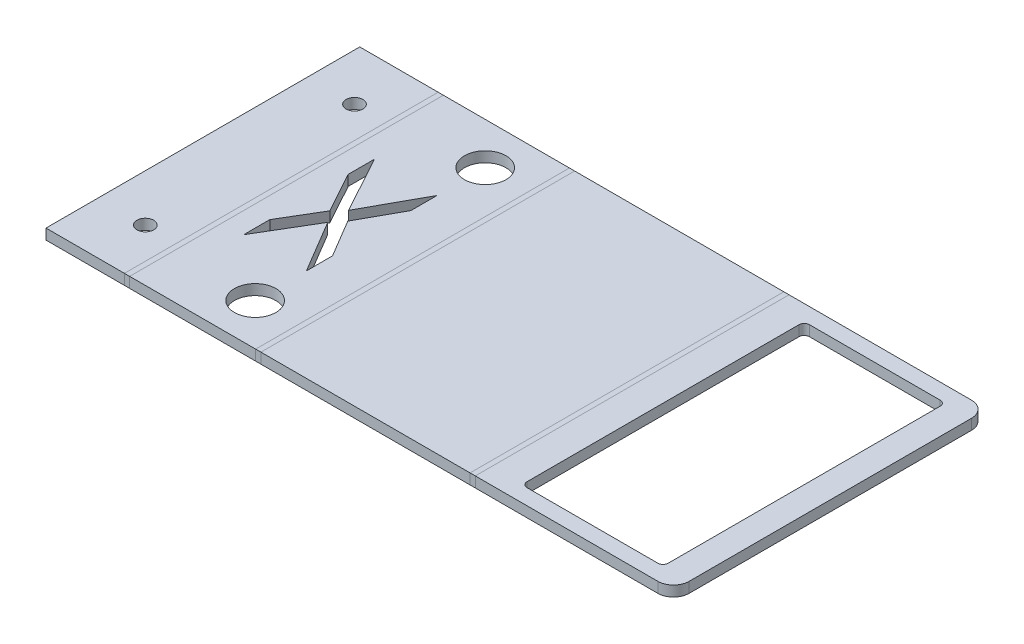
ISO-10303-21;
HEADER;
FILE_DESCRIPTION(('STEP AP214'),'2;1');
FILE_NAME('part.step','',(''),(''),'','','');
FILE_SCHEMA(('AUTOMOTIVE_DESIGN { 1 0 10303 214 1 1 1 1 }'));
ENDSEC;
DATA;
#1=APPLICATION_CONTEXT('core data for automotive mechanical design processes');
#2=APPLICATION_PROTOCOL_DEFINITION('international standard','automotive_design',2000,#1);
#3=PRODUCT_CONTEXT('',#1,'mechanical');
#4=PRODUCT('Part','Part','',(#3));
#5=PRODUCT_RELATED_PRODUCT_CATEGORY('part','',(#4));
#6=PRODUCT_DEFINITION_FORMATION('','',#4);
#7=PRODUCT_DEFINITION_CONTEXT('part definition',#1,'design');
#8=PRODUCT_DEFINITION('design','',#6,#7);
#9=PRODUCT_DEFINITION_SHAPE('','',#8);
#10=(LENGTH_UNIT() NAMED_UNIT(*) SI_UNIT(.MILLI.,.METRE.));
#11=(NAMED_UNIT(*) PLANE_ANGLE_UNIT() SI_UNIT($,.RADIAN.));
#12=(NAMED_UNIT(*) SI_UNIT($,.STERADIAN.) SOLID_ANGLE_UNIT());
#13=UNCERTAINTY_MEASURE_WITH_UNIT(LENGTH_MEASURE(1.E-05),#10,'distance_accuracy_value','');
#14=(GEOMETRIC_REPRESENTATION_CONTEXT(3) GLOBAL_UNCERTAINTY_ASSIGNED_CONTEXT((#13)) GLOBAL_UNIT_ASSIGNED_CONTEXT((#10,
#11,#12)) REPRESENTATION_CONTEXT('',''));
#15=CARTESIAN_POINT('',(0.,0.,0.));
#16=DIRECTION('',(0.,0.,1.));
#17=DIRECTION('',(1.,0.,0.));
#18=AXIS2_PLACEMENT_3D('',#15,#16,#17);
#19=CARTESIAN_POINT('',(38.2058673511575,143.22461496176,0.));
#20=DIRECTION('',(0.,0.,-1.));
#21=DIRECTION('',(0.999390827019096,0.0348994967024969,0.));
#22=AXIS2_PLACEMENT_3D('',#19,#20,#21);
#23=PLANE('',#22);
#24=DIRECTION('',(1.,0.,0.));
#25=VECTOR('',#24,1.);
#26=CARTESIAN_POINT('',(38.2058673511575,-0.999999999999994,0.));
#27=LINE('',#26,#25);
#28=CARTESIAN_POINT('',(41.1029336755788,-0.999999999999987,0.));
#29=VERTEX_POINT('',#28);
#30=CARTESIAN_POINT('',(81.1052447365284,-0.999999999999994,0.));
#31=VERTEX_POINT('',#30);
#32=EDGE_CURVE('E410',#29,#31,#27,.T.);
#33=ORIENTED_EDGE('',*,*,#32,.F.);
#34=DIRECTION('',(0.,-1.,0.));
#35=VECTOR('',#34,1.);
#36=CARTESIAN_POINT('',(41.1029336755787,143.22461496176,0.));
#37=LINE('',#36,#35);
#38=CARTESIAN_POINT('',(41.1029336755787,1.00000000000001,0.));
#39=VERTEX_POINT('',#38);
#40=EDGE_CURVE('E601',#39,#29,#37,.T.);
#41=ORIENTED_EDGE('',*,*,#40,.F.);
#42=DIRECTION('',(1.,0.,0.));
#43=VECTOR('',#42,1.);
#44=CARTESIAN_POINT('',(38.2058673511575,1.,0.));
#45=LINE('',#44,#43);
#46=CARTESIAN_POINT('',(81.1052447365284,1.00000000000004,0.));
#47=VERTEX_POINT('',#46);
#48=EDGE_CURVE('E76',#39,#47,#45,.T.);
#49=ORIENTED_EDGE('',*,*,#48,.T.);
#50=DIRECTION('',(0.,-1.,0.));
#51=VECTOR('',#50,1.);
#52=CARTESIAN_POINT('',(81.1052447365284,143.22461496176,0.));
#53=LINE('',#52,#51);
#54=EDGE_CURVE('E607',#47,#31,#53,.T.);
#55=ORIENTED_EDGE('',*,*,#54,.T.);
#56=EDGE_LOOP('',(#33,#41,#49,#55));
#57=FACE_BOUND('',#56,.T.);
#58=ADVANCED_FACE('F54',(#57),#23,.T.);
#59=CARTESIAN_POINT('',(38.2058673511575,143.22461496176,60.));
#60=DIRECTION('',(0.,0.,-1.));
#61=DIRECTION('',(0.999390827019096,0.0348994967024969,0.));
#62=AXIS2_PLACEMENT_3D('',#59,#60,#61);
#63=PLANE('',#62);
#64=DIRECTION('',(0.,-1.,0.));
#65=VECTOR('',#64,1.);
#66=CARTESIAN_POINT('',(41.1029336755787,143.22461496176,60.));
#67=LINE('',#66,#65);
#68=CARTESIAN_POINT('',(41.1029336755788,1.00000000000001,60.));
#69=VERTEX_POINT('',#68);
#70=CARTESIAN_POINT('',(41.1029336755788,-0.999999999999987,60.));
#71=VERTEX_POINT('',#70);
#72=EDGE_CURVE('E597',#69,#71,#67,.T.);
#73=ORIENTED_EDGE('',*,*,#72,.T.);
#74=DIRECTION('',(1.,0.,0.));
#75=VECTOR('',#74,1.);
#76=CARTESIAN_POINT('',(38.2058673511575,-1.00000000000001,60.));
#77=LINE('',#76,#75);
#78=CARTESIAN_POINT('',(81.1052447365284,-0.999999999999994,59.9999999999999));
#79=VERTEX_POINT('',#78);
#80=EDGE_CURVE('E592',#71,#79,#77,.T.);
#81=ORIENTED_EDGE('',*,*,#80,.T.);
#82=DIRECTION('',(0.,-1.,0.));
#83=VECTOR('',#82,1.);
#84=CARTESIAN_POINT('',(81.1052447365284,143.22461496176,60.));
#85=LINE('',#84,#83);
#86=CARTESIAN_POINT('',(81.1052447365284,1.,60.));
#87=VERTEX_POINT('',#86);
#88=EDGE_CURVE('E13',#87,#79,#85,.T.);
#89=ORIENTED_EDGE('',*,*,#88,.F.);
#90=DIRECTION('',(1.,0.,0.));
#91=VECTOR('',#90,1.);
#92=CARTESIAN_POINT('',(38.2058673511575,1.00000000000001,60.));
#93=LINE('',#92,#91);
#94=EDGE_CURVE('E68',#69,#87,#93,.T.);
#95=ORIENTED_EDGE('',*,*,#94,.F.);
#96=EDGE_LOOP('',(#73,#81,#89,#95));
#97=FACE_BOUND('',#96,.T.);
#98=ADVANCED_FACE('F676',(#97),#63,.F.);
#99=CARTESIAN_POINT('',(38.2058673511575,1.,60.));
#100=DIRECTION('',(0.,1.,0.));
#101=DIRECTION('',(-1.,0.,0.));
#102=AXIS2_PLACEMENT_3D('',#99,#100,#101);
#103=PLANE('',#102);
#104=DIRECTION('',(0.,0.,1.));
#105=VECTOR('',#104,1.);
#106=CARTESIAN_POINT('',(81.1052447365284,1.00000000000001,0.));
#107=LINE('',#106,#105);
#108=EDGE_CURVE('E61',#47,#87,#107,.T.);
#109=ORIENTED_EDGE('',*,*,#108,.F.);
#110=ORIENTED_EDGE('',*,*,#48,.F.);
#111=DIRECTION('',(0.,0.,1.));
#112=VECTOR('',#111,1.);
#113=CARTESIAN_POINT('',(41.1029336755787,0.999999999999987,0.));
#114=LINE('',#113,#112);
#115=EDGE_CURVE('E599',#39,#69,#114,.T.);
#116=ORIENTED_EDGE('',*,*,#115,.T.);
#117=ORIENTED_EDGE('',*,*,#94,.T.);
#118=EDGE_LOOP('',(#109,#110,#116,#117));
#119=FACE_BOUND('',#118,.T.);
#120=ADVANCED_FACE('F674',(#119),#103,.T.);
#121=CARTESIAN_POINT('',(38.2058673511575,-0.999999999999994,60.));
#122=DIRECTION('',(0.,1.,0.));
#123=DIRECTION('',(-1.,0.,0.));
#124=AXIS2_PLACEMENT_3D('',#121,#122,#123);
#125=PLANE('',#124);
#126=ORIENTED_EDGE('',*,*,#32,.T.);
#127=DIRECTION('',(0.,0.,1.));
#128=VECTOR('',#127,1.);
#129=CARTESIAN_POINT('',(81.1052447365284,-1.00000000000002,0.));
#130=LINE('',#129,#128);
#131=EDGE_CURVE('E604',#31,#79,#130,.T.);
#132=ORIENTED_EDGE('',*,*,#131,.T.);
#133=ORIENTED_EDGE('',*,*,#80,.F.);
#134=DIRECTION('',(0.,0.,1.));
#135=VECTOR('',#134,1.);
#136=CARTESIAN_POINT('',(41.1029336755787,-1.00000000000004,0.));
#137=LINE('',#136,#135);
#138=EDGE_CURVE('E594',#29,#71,#137,.T.);
#139=ORIENTED_EDGE('',*,*,#138,.F.);
#140=EDGE_LOOP('',(#126,#132,#133,#139));
#141=FACE_BOUND('',#140,.T.);
#142=ADVANCED_FACE('F645',(#141),#125,.F.);
#143=CARTESIAN_POINT('',(0.,122.69316876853,60.));
#144=DIRECTION('',(-1.,0.,0.));
#145=DIRECTION('',(0.,-1.,0.));
#146=AXIS2_PLACEMENT_3D('',#143,#144,#145);
#147=PLANE('',#146);
#148=DIRECTION('',(0.,0.,-1.));
#149=VECTOR('',#148,1.);
#150=CARTESIAN_POINT('',(0.,-0.999999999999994,60.));
#151=LINE('',#150,#149);
#152=CARTESIAN_POINT('',(0.,-0.999999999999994,60.));
#153=VERTEX_POINT('',#152);
#154=CARTESIAN_POINT('',(0.,-0.999999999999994,0.));
#155=VERTEX_POINT('',#154);
#156=EDGE_CURVE('E548',#153,#155,#151,.T.);
#157=ORIENTED_EDGE('',*,*,#156,.F.);
#158=DIRECTION('',(0.,-1.,0.));
#159=VECTOR('',#158,1.);
#160=CARTESIAN_POINT('',(0.,122.69316876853,60.));
#161=LINE('',#160,#159);
#162=CARTESIAN_POINT('',(0.,1.,60.));
#163=VERTEX_POINT('',#162);
#164=EDGE_CURVE('E557',#163,#153,#161,.T.);
#165=ORIENTED_EDGE('',*,*,#164,.F.);
#166=DIRECTION('',(0.,0.,-1.));
#167=VECTOR('',#166,1.);
#168=CARTESIAN_POINT('',(0.,1.00000000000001,60.));
#169=LINE('',#168,#167);
#170=CARTESIAN_POINT('',(0.,0.999999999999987,0.));
#171=VERTEX_POINT('',#170);
#172=EDGE_CURVE('E582',#163,#171,#169,.T.);
#173=ORIENTED_EDGE('',*,*,#172,.T.);
#174=DIRECTION('',(0.,-1.,0.));
#175=VECTOR('',#174,1.);
#176=CARTESIAN_POINT('',(0.,122.69316876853,0.));
#177=LINE('',#176,#175);
#178=EDGE_CURVE('E579',#171,#155,#177,.T.);
#179=ORIENTED_EDGE('',*,*,#178,.T.);
#180=EDGE_LOOP('',(#157,#165,#173,#179));
#181=FACE_BOUND('',#180,.T.);
#182=ADVANCED_FACE('F682',(#181),#147,.T.);
#183=CARTESIAN_POINT('',(9.,9.00000000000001,50.));
#184=DIRECTION('',(0.,-1.,0.));
#185=DIRECTION('',(1.,0.,0.));
#186=AXIS2_PLACEMENT_3D('',#183,#184,#185);
#187=CYLINDRICAL_SURFACE('',#186,1.6);
#188=CARTESIAN_POINT('',(9.,1.00000000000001,50.));
#189=DIRECTION('',(0.,1.,0.));
#190=DIRECTION('',(0.,0.,1.));
#191=AXIS2_PLACEMENT_3D('',#188,#189,#190);
#192=CIRCLE('',#191,1.6);
#193=CARTESIAN_POINT('',(9.,1.00000000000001,51.6));
#194=VERTEX_POINT('',#193);
#195=EDGE_CURVE('E576',#194,#194,#192,.T.);
#196=ORIENTED_EDGE('',*,*,#195,.T.);
#197=EDGE_LOOP('',(#196));
#198=FACE_BOUND('',#197,.T.);
#199=CARTESIAN_POINT('',(9.,-0.999999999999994,50.));
#200=DIRECTION('',(0.,-1.,0.));
#201=DIRECTION('',(1.,0.,0.));
#202=AXIS2_PLACEMENT_3D('',#199,#200,#201);
#203=CIRCLE('',#202,1.6);
#204=CARTESIAN_POINT('',(10.6,-0.999999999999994,50.));
#205=VERTEX_POINT('',#204);
#206=EDGE_CURVE('E573',#205,#205,#203,.T.);
#207=ORIENTED_EDGE('',*,*,#206,.T.);
#208=EDGE_LOOP('',(#207));
#209=FACE_BOUND('',#208,.T.);
#210=ADVANCED_FACE('F702',(#198,#209),#187,.F.);
#211=CARTESIAN_POINT('',(9.00000000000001,9.00000000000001,9.99999999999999));
#212=DIRECTION('',(0.,-1.,0.));
#213=DIRECTION('',(1.,0.,0.));
#214=AXIS2_PLACEMENT_3D('',#211,#212,#213);
#215=CYLINDRICAL_SURFACE('',#214,1.6);
#216=CARTESIAN_POINT('',(9.00000000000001,1.00000000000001,9.99999999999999));
#217=DIRECTION('',(0.,1.,0.));
#218=DIRECTION('',(0.,0.,1.));
#219=AXIS2_PLACEMENT_3D('',#216,#217,#218);
#220=CIRCLE('',#219,1.6);
#221=CARTESIAN_POINT('',(9.00000000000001,1.00000000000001,11.6));
#222=VERTEX_POINT('',#221);
#223=EDGE_CURVE('E570',#222,#222,#220,.T.);
#224=ORIENTED_EDGE('',*,*,#223,.T.);
#225=EDGE_LOOP('',(#224));
#226=FACE_BOUND('',#225,.T.);
#227=CARTESIAN_POINT('',(9.00000000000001,-0.999999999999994,9.99999999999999));
#228=DIRECTION('',(0.,-1.,0.));
#229=DIRECTION('',(1.,0.,0.));
#230=AXIS2_PLACEMENT_3D('',#227,#228,#229);
#231=CIRCLE('',#230,1.6);
#232=CARTESIAN_POINT('',(10.6,-0.999999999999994,9.99999999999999));
#233=VERTEX_POINT('',#232);
#234=EDGE_CURVE('E567',#233,#233,#231,.T.);
#235=ORIENTED_EDGE('',*,*,#234,.T.);
#236=EDGE_LOOP('',(#235));
#237=FACE_BOUND('',#236,.T.);
#238=ADVANCED_FACE('F713',(#226,#237),#215,.F.);
#239=CARTESIAN_POINT('',(0.,122.69316876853,0.));
#240=DIRECTION('',(0.,0.,-1.));
#241=DIRECTION('',(0.999390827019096,0.0348994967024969,0.));
#242=AXIS2_PLACEMENT_3D('',#239,#240,#241);
#243=PLANE('',#242);
#244=DIRECTION('',(1.,0.,0.));
#245=VECTOR('',#244,1.);
#246=CARTESIAN_POINT('',(0.,-0.999999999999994,0.));
#247=LINE('',#246,#245);
#248=CARTESIAN_POINT('',(15.,-0.999999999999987,0.));
#249=VERTEX_POINT('',#248);
#250=EDGE_CURVE('E552',#155,#249,#247,.T.);
#251=ORIENTED_EDGE('',*,*,#250,.F.);
#252=ORIENTED_EDGE('',*,*,#178,.F.);
#253=DIRECTION('',(1.,0.,0.));
#254=VECTOR('',#253,1.);
#255=CARTESIAN_POINT('',(0.,1.00000000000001,0.));
#256=LINE('',#255,#254);
#257=CARTESIAN_POINT('',(15.,1.00000000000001,0.));
#258=VERTEX_POINT('',#257);
#259=EDGE_CURVE('E565',#171,#258,#256,.T.);
#260=ORIENTED_EDGE('',*,*,#259,.T.);
#261=DIRECTION('',(0.,-1.,0.));
#262=VECTOR('',#261,1.);
#263=CARTESIAN_POINT('',(15.,122.69316876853,0.));
#264=LINE('',#263,#262);
#265=EDGE_CURVE('E562',#258,#249,#264,.T.);
#266=ORIENTED_EDGE('',*,*,#265,.T.);
#267=EDGE_LOOP('',(#251,#252,#260,#266));
#268=FACE_BOUND('',#267,.T.);
#269=ADVANCED_FACE('F722',(#268),#243,.T.);
#270=CARTESIAN_POINT('',(0.,1.00000000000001,60.));
#271=DIRECTION('',(0.,1.,0.));
#272=DIRECTION('',(0.,0.,1.));
#273=AXIS2_PLACEMENT_3D('',#270,#271,#272);
#274=PLANE('',#273);
#275=ORIENTED_EDGE('',*,*,#223,.F.);
#276=EDGE_LOOP('',(#275));
#277=FACE_BOUND('',#276,.T.);
#278=ORIENTED_EDGE('',*,*,#195,.F.);
#279=EDGE_LOOP('',(#278));
#280=FACE_BOUND('',#279,.T.);
#281=DIRECTION('',(0.,0.,1.));
#282=VECTOR('',#281,1.);
#283=CARTESIAN_POINT('',(15.,1.00000000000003,0.));
#284=LINE('',#283,#282);
#285=CARTESIAN_POINT('',(15.,1.00000000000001,59.9999999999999));
#286=VERTEX_POINT('',#285);
#287=EDGE_CURVE('E539',#258,#286,#284,.T.);
#288=ORIENTED_EDGE('',*,*,#287,.F.);
#289=ORIENTED_EDGE('',*,*,#259,.F.);
#290=ORIENTED_EDGE('',*,*,#172,.F.);
#291=DIRECTION('',(1.,0.,0.));
#292=VECTOR('',#291,1.);
#293=CARTESIAN_POINT('',(0.,1.00000000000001,60.));
#294=LINE('',#293,#292);
#295=EDGE_CURVE('E560',#163,#286,#294,.T.);
#296=ORIENTED_EDGE('',*,*,#295,.T.);
#297=EDGE_LOOP('',(#288,#289,#290,#296));
#298=FACE_BOUND('',#297,.T.);
#299=ADVANCED_FACE('F731',(#277,#280,#298),#274,.T.);
#300=CARTESIAN_POINT('',(0.,122.69316876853,60.));
#301=DIRECTION('',(0.,0.,-1.));
#302=DIRECTION('',(0.999390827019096,0.0348994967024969,0.));
#303=AXIS2_PLACEMENT_3D('',#300,#301,#302);
#304=PLANE('',#303);
#305=ORIENTED_EDGE('',*,*,#164,.T.);
#306=DIRECTION('',(1.,0.,0.));
#307=VECTOR('',#306,1.);
#308=CARTESIAN_POINT('',(0.,-0.999999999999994,60.));
#309=LINE('',#308,#307);
#310=CARTESIAN_POINT('',(15.,-0.999999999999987,59.9999999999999));
#311=VERTEX_POINT('',#310);
#312=EDGE_CURVE('E554',#153,#311,#309,.T.);
#313=ORIENTED_EDGE('',*,*,#312,.T.);
#314=DIRECTION('',(0.,-1.,0.));
#315=VECTOR('',#314,1.);
#316=CARTESIAN_POINT('',(15.,122.69316876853,60.));
#317=LINE('',#316,#315);
#318=EDGE_CURVE('E533',#286,#311,#317,.T.);
#319=ORIENTED_EDGE('',*,*,#318,.F.);
#320=ORIENTED_EDGE('',*,*,#295,.F.);
#321=EDGE_LOOP('',(#305,#313,#319,#320));
#322=FACE_BOUND('',#321,.T.);
#323=ADVANCED_FACE('F741',(#322),#304,.F.);
#324=CARTESIAN_POINT('',(0.,-0.999999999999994,60.));
#325=DIRECTION('',(0.,1.,0.));
#326=DIRECTION('',(0.,0.,1.));
#327=AXIS2_PLACEMENT_3D('',#324,#325,#326);
#328=PLANE('',#327);
#329=ORIENTED_EDGE('',*,*,#234,.F.);
#330=EDGE_LOOP('',(#329));
#331=FACE_BOUND('',#330,.T.);
#332=ORIENTED_EDGE('',*,*,#206,.F.);
#333=EDGE_LOOP('',(#332));
#334=FACE_BOUND('',#333,.T.);
#335=ORIENTED_EDGE('',*,*,#250,.T.);
#336=DIRECTION('',(0.,0.,1.));
#337=VECTOR('',#336,1.);
#338=CARTESIAN_POINT('',(15.,-0.99999999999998,0.));
#339=LINE('',#338,#337);
#340=EDGE_CURVE('E550',#249,#311,#339,.T.);
#341=ORIENTED_EDGE('',*,*,#340,.T.);
#342=ORIENTED_EDGE('',*,*,#312,.F.);
#343=ORIENTED_EDGE('',*,*,#156,.T.);
#344=EDGE_LOOP('',(#335,#341,#342,#343));
#345=FACE_BOUND('',#344,.T.);
#346=ADVANCED_FACE('F751',(#331,#334,#345),#328,.F.);
#347=CARTESIAN_POINT('',(15.,-0.999999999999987,0.));
#348=DIRECTION('',(0.,0.,-1.));
#349=DIRECTION('',(1.,0.,0.));
#350=AXIS2_PLACEMENT_3D('',#347,#348,#349);
#351=PLANE('',#350);
#352=ORIENTED_EDGE('',*,*,#265,.F.);
#353=DIRECTION('',(1.,0.,0.));
#354=VECTOR('',#353,1.);
#355=CARTESIAN_POINT('',(16.5707963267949,1.00000000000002,0.));
#356=LINE('',#355,#354);
#357=CARTESIAN_POINT('',(16.,1.00000000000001,0.));
#358=VERTEX_POINT('',#357);
#359=EDGE_CURVE('E545',#258,#358,#356,.T.);
#360=ORIENTED_EDGE('',*,*,#359,.T.);
#361=DIRECTION('',(0.,-1.,0.));
#362=VECTOR('',#361,1.);
#363=CARTESIAN_POINT('',(16.,128.320553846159,0.));
#364=LINE('',#363,#362);
#365=CARTESIAN_POINT('',(16.,-0.999999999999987,0.));
#366=VERTEX_POINT('',#365);
#367=EDGE_CURVE('E542',#358,#366,#364,.T.);
#368=ORIENTED_EDGE('',*,*,#367,.T.);
#369=DIRECTION('',(1.,0.,0.));
#370=VECTOR('',#369,1.);
#371=CARTESIAN_POINT('',(15.,-0.999999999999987,0.));
#372=LINE('',#371,#370);
#373=EDGE_CURVE('E527',#249,#366,#372,.T.);
#374=ORIENTED_EDGE('',*,*,#373,.F.);
#375=EDGE_LOOP('',(#352,#360,#368,#374));
#376=FACE_BOUND('',#375,.T.);
#377=ADVANCED_FACE('F761',(#376),#351,.T.);
#378=CARTESIAN_POINT('',(16.5707963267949,1.00000000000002,30.));
#379=DIRECTION('',(0.,-1.,0.));
#380=DIRECTION('',(0.,0.,-1.));
#381=AXIS2_PLACEMENT_3D('',#378,#379,#380);
#382=PLANE('',#381);
#383=DIRECTION('',(1.,0.,0.));
#384=VECTOR('',#383,1.);
#385=CARTESIAN_POINT('',(16.5707963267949,1.00000000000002,60.));
#386=LINE('',#385,#384);
#387=CARTESIAN_POINT('',(16.,1.00000000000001,59.9999999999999));
#388=VERTEX_POINT('',#387);
#389=EDGE_CURVE('E536',#388,#286,#386,.F.);
#390=ORIENTED_EDGE('',*,*,#389,.F.);
#391=DIRECTION('',(0.,0.,1.));
#392=VECTOR('',#391,1.);
#393=CARTESIAN_POINT('',(16.,1.00000000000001,0.));
#394=LINE('',#393,#392);
#395=EDGE_CURVE('E415',#358,#388,#394,.T.);
#396=ORIENTED_EDGE('',*,*,#395,.F.);
#397=ORIENTED_EDGE('',*,*,#359,.F.);
#398=ORIENTED_EDGE('',*,*,#287,.T.);
#399=EDGE_LOOP('',(#390,#396,#397,#398));
#400=FACE_BOUND('',#399,.T.);
#401=ADVANCED_FACE('F771',(#400),#382,.F.);
#402=CARTESIAN_POINT('',(16.,-0.999999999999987,60.));
#403=DIRECTION('',(0.,0.,1.));
#404=DIRECTION('',(-1.,0.,0.));
#405=AXIS2_PLACEMENT_3D('',#402,#403,#404);
#406=PLANE('',#405);
#407=DIRECTION('',(0.,-1.,0.));
#408=VECTOR('',#407,1.);
#409=CARTESIAN_POINT('',(16.,128.320553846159,60.));
#410=LINE('',#409,#408);
#411=CARTESIAN_POINT('',(16.,-0.999999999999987,60.));
#412=VERTEX_POINT('',#411);
#413=EDGE_CURVE('E420',#388,#412,#410,.T.);
#414=ORIENTED_EDGE('',*,*,#413,.F.);
#415=ORIENTED_EDGE('',*,*,#389,.T.);
#416=ORIENTED_EDGE('',*,*,#318,.T.);
#417=DIRECTION('',(-1.,0.,0.));
#418=VECTOR('',#417,1.);
#419=CARTESIAN_POINT('',(16.,-0.999999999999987,60.));
#420=LINE('',#419,#418);
#421=EDGE_CURVE('E530',#412,#311,#420,.T.);
#422=ORIENTED_EDGE('',*,*,#421,.F.);
#423=EDGE_LOOP('',(#414,#415,#416,#422));
#424=FACE_BOUND('',#423,.T.);
#425=ADVANCED_FACE('F781',(#424),#406,.T.);
#426=CARTESIAN_POINT('',(16.5707963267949,-0.99999999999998,30.));
#427=DIRECTION('',(0.,-1.,0.));
#428=DIRECTION('',(0.,0.,-1.));
#429=AXIS2_PLACEMENT_3D('',#426,#427,#428);
#430=PLANE('',#429);
#431=ORIENTED_EDGE('',*,*,#421,.T.);
#432=ORIENTED_EDGE('',*,*,#340,.F.);
#433=ORIENTED_EDGE('',*,*,#373,.T.);
#434=DIRECTION('',(0.,0.,1.));
#435=VECTOR('',#434,1.);
#436=CARTESIAN_POINT('',(16.,-1.00000000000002,0.));
#437=LINE('',#436,#435);
#438=EDGE_CURVE('E524',#366,#412,#437,.T.);
#439=ORIENTED_EDGE('',*,*,#438,.T.);
#440=EDGE_LOOP('',(#431,#432,#433,#439));
#441=FACE_BOUND('',#440,.T.);
#442=ADVANCED_FACE('F791',(#441),#430,.T.);
#443=CARTESIAN_POINT('',(32.,9.00000000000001,52.));
#444=DIRECTION('',(0.,-1.,0.));
#445=DIRECTION('',(0.,0.,-1.));
#446=AXIS2_PLACEMENT_3D('',#443,#444,#445);
#447=CYLINDRICAL_SURFACE('',#446,3.968937);
#448=CARTESIAN_POINT('',(32.,1.00000000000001,52.));
#449=DIRECTION('',(0.,1.,0.));
#450=DIRECTION('',(0.,0.,1.));
#451=AXIS2_PLACEMENT_3D('',#448,#449,#450);
#452=CIRCLE('',#451,3.968937);
#453=CARTESIAN_POINT('',(32.,1.00000000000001,55.968937));
#454=VERTEX_POINT('',#453);
#455=EDGE_CURVE('E521',#454,#454,#452,.T.);
#456=ORIENTED_EDGE('',*,*,#455,.T.);
#457=EDGE_LOOP('',(#456));
#458=FACE_BOUND('',#457,.T.);
#459=CARTESIAN_POINT('',(32.,-0.999999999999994,52.));
#460=DIRECTION('',(0.,-1.,0.));
#461=DIRECTION('',(0.,0.,-1.));
#462=AXIS2_PLACEMENT_3D('',#459,#460,#461);
#463=CIRCLE('',#462,3.968937);
#464=CARTESIAN_POINT('',(32.,-0.999999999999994,48.031063));
#465=VERTEX_POINT('',#464);
#466=EDGE_CURVE('E518',#465,#465,#463,.T.);
#467=ORIENTED_EDGE('',*,*,#466,.T.);
#468=EDGE_LOOP('',(#467));
#469=FACE_BOUND('',#468,.T.);
#470=ADVANCED_FACE('F801',(#458,#469),#447,.F.);
#471=CARTESIAN_POINT('',(32.,9.00000000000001,8.));
#472=DIRECTION('',(0.,-1.,0.));
#473=DIRECTION('',(0.,0.,-1.));
#474=AXIS2_PLACEMENT_3D('',#471,#472,#473);
#475=CYLINDRICAL_SURFACE('',#474,3.968937);
#476=CARTESIAN_POINT('',(32.,1.00000000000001,8.));
#477=DIRECTION('',(0.,1.,0.));
#478=DIRECTION('',(0.,0.,1.));
#479=AXIS2_PLACEMENT_3D('',#476,#477,#478);
#480=CIRCLE('',#479,3.968937);
#481=CARTESIAN_POINT('',(32.,1.00000000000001,11.968937));
#482=VERTEX_POINT('',#481);
#483=EDGE_CURVE('E515',#482,#482,#480,.T.);
#484=ORIENTED_EDGE('',*,*,#483,.T.);
#485=EDGE_LOOP('',(#484));
#486=FACE_BOUND('',#485,.T.);
#487=CARTESIAN_POINT('',(32.,-0.999999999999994,8.));
#488=DIRECTION('',(0.,-1.,0.));
#489=DIRECTION('',(0.,0.,-1.));
#490=AXIS2_PLACEMENT_3D('',#487,#488,#489);
#491=CIRCLE('',#490,3.968937);
#492=CARTESIAN_POINT('',(32.,-0.999999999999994,4.031063));
#493=VERTEX_POINT('',#492);
#494=EDGE_CURVE('E512',#493,#493,#491,.T.);
#495=ORIENTED_EDGE('',*,*,#494,.T.);
#496=EDGE_LOOP('',(#495));
#497=FACE_BOUND('',#496,.T.);
#498=ADVANCED_FACE('F811',(#486,#497),#475,.F.);
#499=CARTESIAN_POINT('',(26.,9.00000000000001,28.1172227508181));
#500=DIRECTION('',(0.876238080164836,0.,-0.481878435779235));
#501=DIRECTION('',(0.481878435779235,0.,0.876238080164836));
#502=AXIS2_PLACEMENT_3D('',#499,#500,#501);
#503=PLANE('',#502);
#504=DIRECTION('',(-0.481878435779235,0.,-0.876238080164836));
#505=VECTOR('',#504,1.);
#506=CARTESIAN_POINT('',(36.4435026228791,1.00000000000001,47.1074784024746));
#507=LINE('',#506,#505);
#508=CARTESIAN_POINT('',(26.,1.00000000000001,28.1172227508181));
#509=VERTEX_POINT('',#508);
#510=CARTESIAN_POINT('',(20.,1.00000000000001,17.2069431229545));
#511=VERTEX_POINT('',#510);
#512=EDGE_CURVE('E509',#509,#511,#507,.T.);
#513=ORIENTED_EDGE('',*,*,#512,.T.);
#514=DIRECTION('',(0.,-1.,0.));
#515=VECTOR('',#514,1.);
#516=CARTESIAN_POINT('',(20.,9.00000000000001,17.2069431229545));
#517=LINE('',#516,#515);
#518=CARTESIAN_POINT('',(20.,-0.999999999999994,17.2069431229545));
#519=VERTEX_POINT('',#518);
#520=EDGE_CURVE('E507',#511,#519,#517,.T.);
#521=ORIENTED_EDGE('',*,*,#520,.T.);
#522=DIRECTION('',(0.481878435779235,0.,0.876238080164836));
#523=VECTOR('',#522,1.);
#524=CARTESIAN_POINT('',(26.,-0.999999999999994,28.1172227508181));
#525=LINE('',#524,#523);
#526=CARTESIAN_POINT('',(26.,-0.999999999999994,28.1172227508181));
#527=VERTEX_POINT('',#526);
#528=EDGE_CURVE('E504',#519,#527,#525,.T.);
#529=ORIENTED_EDGE('',*,*,#528,.T.);
#530=DIRECTION('',(0.,-1.,0.));
#531=VECTOR('',#530,1.);
#532=CARTESIAN_POINT('',(26.,9.00000000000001,28.1172227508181));
#533=LINE('',#532,#531);
#534=EDGE_CURVE('E500',#509,#527,#533,.T.);
#535=ORIENTED_EDGE('',*,*,#534,.F.);
#536=EDGE_LOOP('',(#513,#521,#529,#535));
#537=FACE_BOUND('',#536,.T.);
#538=ADVANCED_FACE('F820',(#537),#503,.F.);
#539=CARTESIAN_POINT('',(32.,9.00000000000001,17.2069431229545));
#540=DIRECTION('',(-0.876238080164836,0.,-0.481878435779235));
#541=DIRECTION('',(0.481878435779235,0.,-0.876238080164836));
#542=AXIS2_PLACEMENT_3D('',#539,#540,#541);
#543=PLANE('',#542);
#544=DIRECTION('',(-0.481878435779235,0.,0.876238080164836));
#545=VECTOR('',#544,1.);
#546=CARTESIAN_POINT('',(9.51911987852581,1.00000000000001,58.0857245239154));
#547=LINE('',#546,#545);
#548=CARTESIAN_POINT('',(32.,1.00000000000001,17.2069431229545));
#549=VERTEX_POINT('',#548);
#550=EDGE_CURVE('E502',#549,#509,#547,.T.);
#551=ORIENTED_EDGE('',*,*,#550,.T.);
#552=ORIENTED_EDGE('',*,*,#534,.T.);
#553=DIRECTION('',(0.481878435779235,0.,-0.876238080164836));
#554=VECTOR('',#553,1.);
#555=CARTESIAN_POINT('',(32.,-0.999999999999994,17.2069431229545));
#556=LINE('',#555,#554);
#557=CARTESIAN_POINT('',(32.,-0.999999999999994,17.2069431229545));
#558=VERTEX_POINT('',#557);
#559=EDGE_CURVE('E497',#527,#558,#556,.T.);
#560=ORIENTED_EDGE('',*,*,#559,.T.);
#561=DIRECTION('',(0.,-1.,0.));
#562=VECTOR('',#561,1.);
#563=CARTESIAN_POINT('',(32.,9.00000000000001,17.2069431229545));
#564=LINE('',#563,#562);
#565=EDGE_CURVE('E493',#549,#558,#564,.T.);
#566=ORIENTED_EDGE('',*,*,#565,.F.);
#567=EDGE_LOOP('',(#551,#552,#560,#566));
#568=FACE_BOUND('',#567,.T.);
#569=ADVANCED_FACE('F829',(#568),#543,.F.);
#570=CARTESIAN_POINT('',(32.,9.00000000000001,22.2069431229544));
#571=DIRECTION('',(1.,0.,0.));
#572=DIRECTION('',(0.,0.,1.));
#573=AXIS2_PLACEMENT_3D('',#570,#571,#572);
#574=PLANE('',#573);
#575=DIRECTION('',(0.,0.,-1.));
#576=VECTOR('',#575,1.);
#577=CARTESIAN_POINT('',(32.,1.00000000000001,60.));
#578=LINE('',#577,#576);
#579=CARTESIAN_POINT('',(32.,1.00000000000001,22.2069431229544));
#580=VERTEX_POINT('',#579);
#581=EDGE_CURVE('E495',#580,#549,#578,.T.);
#582=ORIENTED_EDGE('',*,*,#581,.T.);
#583=ORIENTED_EDGE('',*,*,#565,.T.);
#584=DIRECTION('',(0.,0.,1.));
#585=VECTOR('',#584,1.);
#586=CARTESIAN_POINT('',(32.,-0.999999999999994,22.2069431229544));
#587=LINE('',#586,#585);
#588=CARTESIAN_POINT('',(32.,-0.999999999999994,22.2069431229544));
#589=VERTEX_POINT('',#588);
#590=EDGE_CURVE('E490',#558,#589,#587,.T.);
#591=ORIENTED_EDGE('',*,*,#590,.T.);
#592=DIRECTION('',(0.,-1.,0.));
#593=VECTOR('',#592,1.);
#594=CARTESIAN_POINT('',(32.,9.00000000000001,22.2069431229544));
#595=LINE('',#594,#593);
#596=EDGE_CURVE('E486',#580,#589,#595,.T.);
#597=ORIENTED_EDGE('',*,*,#596,.F.);
#598=EDGE_LOOP('',(#582,#583,#591,#597));
#599=FACE_BOUND('',#598,.T.);
#600=ADVANCED_FACE('F838',(#599),#574,.F.);
#601=CARTESIAN_POINT('',(27.7142857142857,9.00000000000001,30.));
#602=DIRECTION('',(0.876238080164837,0.,0.481878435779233));
#603=DIRECTION('',(-0.481878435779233,0.,0.876238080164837));
#604=AXIS2_PLACEMENT_3D('',#601,#602,#603);
#605=PLANE('',#604);
#606=DIRECTION('',(0.481878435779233,0.,-0.876238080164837));
#607=VECTOR('',#606,1.);
#608=CARTESIAN_POINT('',(11.6303210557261,1.00000000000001,59.2467586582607));
#609=LINE('',#608,#607);
#610=CARTESIAN_POINT('',(27.7142857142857,1.00000000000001,30.));
#611=VERTEX_POINT('',#610);
#612=EDGE_CURVE('E488',#611,#580,#609,.T.);
#613=ORIENTED_EDGE('',*,*,#612,.T.);
#614=ORIENTED_EDGE('',*,*,#596,.T.);
#615=DIRECTION('',(-0.481878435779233,0.,0.876238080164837));
#616=VECTOR('',#615,1.);
#617=CARTESIAN_POINT('',(27.7142857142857,-0.999999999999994,30.));
#618=LINE('',#617,#616);
#619=CARTESIAN_POINT('',(27.7142857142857,-0.999999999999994,30.));
#620=VERTEX_POINT('',#619);
#621=EDGE_CURVE('E483',#589,#620,#618,.T.);
#622=ORIENTED_EDGE('',*,*,#621,.T.);
#623=DIRECTION('',(0.,-1.,0.));
#624=VECTOR('',#623,1.);
#625=CARTESIAN_POINT('',(27.7142857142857,9.00000000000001,30.));
#626=LINE('',#625,#624);
#627=EDGE_CURVE('E479',#611,#620,#626,.T.);
#628=ORIENTED_EDGE('',*,*,#627,.F.);
#629=EDGE_LOOP('',(#613,#614,#622,#628));
#630=FACE_BOUND('',#629,.T.);
#631=ADVANCED_FACE('F847',(#630),#605,.F.);
#632=CARTESIAN_POINT('',(32.,9.00000000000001,37.2069431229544));
#633=DIRECTION('',(0.859509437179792,0.,-0.511119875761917));
#634=DIRECTION('',(0.511119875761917,0.,0.859509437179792));
#635=AXIS2_PLACEMENT_3D('',#632,#633,#634);
#636=PLANE('',#635);
#637=DIRECTION('',(-0.511119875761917,0.,-0.859509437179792));
#638=VECTOR('',#637,1.);
#639=CARTESIAN_POINT('',(37.0496445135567,1.00000000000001,45.6985266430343));
#640=LINE('',#639,#638);
#641=CARTESIAN_POINT('',(32.,1.00000000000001,37.2069431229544));
#642=VERTEX_POINT('',#641);
#643=EDGE_CURVE('E481',#642,#611,#640,.T.);
#644=ORIENTED_EDGE('',*,*,#643,.T.);
#645=ORIENTED_EDGE('',*,*,#627,.T.);
#646=DIRECTION('',(0.511119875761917,0.,0.859509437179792));
#647=VECTOR('',#646,1.);
#648=CARTESIAN_POINT('',(32.,-0.999999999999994,37.2069431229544));
#649=LINE('',#648,#647);
#650=CARTESIAN_POINT('',(32.,-0.999999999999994,37.2069431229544));
#651=VERTEX_POINT('',#650);
#652=EDGE_CURVE('E476',#620,#651,#649,.T.);
#653=ORIENTED_EDGE('',*,*,#652,.T.);
#654=DIRECTION('',(0.,-1.,0.));
#655=VECTOR('',#654,1.);
#656=CARTESIAN_POINT('',(32.,9.00000000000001,37.2069431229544));
#657=LINE('',#656,#655);
#658=EDGE_CURVE('E472',#642,#651,#657,.T.);
#659=ORIENTED_EDGE('',*,*,#658,.F.);
#660=EDGE_LOOP('',(#644,#645,#653,#659));
#661=FACE_BOUND('',#660,.T.);
#662=ADVANCED_FACE('F856',(#661),#636,.F.);
#663=CARTESIAN_POINT('',(32.,9.00000000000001,42.2069431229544));
#664=DIRECTION('',(1.,0.,0.));
#665=DIRECTION('',(0.,0.,1.));
#666=AXIS2_PLACEMENT_3D('',#663,#664,#665);
#667=PLANE('',#666);
#668=DIRECTION('',(0.,0.,-1.));
#669=VECTOR('',#668,1.);
#670=CARTESIAN_POINT('',(32.,1.00000000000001,60.));
#671=LINE('',#670,#669);
#672=CARTESIAN_POINT('',(32.,1.00000000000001,42.2069431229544));
#673=VERTEX_POINT('',#672);
#674=EDGE_CURVE('E474',#673,#642,#671,.T.);
#675=ORIENTED_EDGE('',*,*,#674,.T.);
#676=ORIENTED_EDGE('',*,*,#658,.T.);
#677=DIRECTION('',(0.,0.,1.));
#678=VECTOR('',#677,1.);
#679=CARTESIAN_POINT('',(32.,-0.999999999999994,42.2069431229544));
#680=LINE('',#679,#678);
#681=CARTESIAN_POINT('',(32.,-0.999999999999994,42.2069431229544));
#682=VERTEX_POINT('',#681);
#683=EDGE_CURVE('E469',#651,#682,#680,.T.);
#684=ORIENTED_EDGE('',*,*,#683,.T.);
#685=DIRECTION('',(0.,-1.,0.));
#686=VECTOR('',#685,1.);
#687=CARTESIAN_POINT('',(32.,9.00000000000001,42.2069431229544));
#688=LINE('',#687,#686);
#689=EDGE_CURVE('E465',#673,#682,#688,.T.);
#690=ORIENTED_EDGE('',*,*,#689,.F.);
#691=EDGE_LOOP('',(#675,#676,#684,#690));
#692=FACE_BOUND('',#691,.T.);
#693=ADVANCED_FACE('F865',(#692),#667,.F.);
#694=CARTESIAN_POINT('',(26.,9.00000000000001,32.1172227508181));
#695=DIRECTION('',(-0.859509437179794,0.,0.511119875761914));
#696=DIRECTION('',(-0.511119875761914,0.,-0.859509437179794));
#697=AXIS2_PLACEMENT_3D('',#694,#695,#696);
#698=PLANE('',#697);
#699=DIRECTION('',(0.511119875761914,0.,0.859509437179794));
#700=VECTOR('',#699,1.);
#701=CARTESIAN_POINT('',(34.8530827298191,1.00000000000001,47.0047442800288));
#702=LINE('',#701,#700);
#703=CARTESIAN_POINT('',(26.,1.00000000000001,32.1172227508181));
#704=VERTEX_POINT('',#703);
#705=EDGE_CURVE('E467',#704,#673,#702,.T.);
#706=ORIENTED_EDGE('',*,*,#705,.T.);
#707=ORIENTED_EDGE('',*,*,#689,.T.);
#708=DIRECTION('',(-0.511119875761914,0.,-0.859509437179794));
#709=VECTOR('',#708,1.);
#710=CARTESIAN_POINT('',(26.,-0.999999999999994,32.1172227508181));
#711=LINE('',#710,#709);
#712=CARTESIAN_POINT('',(26.,-0.999999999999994,32.1172227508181));
#713=VERTEX_POINT('',#712);
#714=EDGE_CURVE('E462',#682,#713,#711,.T.);
#715=ORIENTED_EDGE('',*,*,#714,.T.);
#716=DIRECTION('',(0.,-1.,0.));
#717=VECTOR('',#716,1.);
#718=CARTESIAN_POINT('',(26.,9.00000000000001,32.1172227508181));
#719=LINE('',#718,#717);
#720=EDGE_CURVE('E458',#704,#713,#719,.T.);
#721=ORIENTED_EDGE('',*,*,#720,.F.);
#722=EDGE_LOOP('',(#706,#707,#715,#721));
#723=FACE_BOUND('',#722,.T.);
#724=ADVANCED_FACE('F874',(#723),#698,.F.);
#725=CARTESIAN_POINT('',(20.,9.00000000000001,42.2069431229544));
#726=DIRECTION('',(0.859509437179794,0.,0.511119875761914));
#727=DIRECTION('',(-0.511119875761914,0.,0.859509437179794));
#728=AXIS2_PLACEMENT_3D('',#725,#726,#727);
#729=PLANE('',#728);
#730=DIRECTION('',(0.511119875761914,0.,-0.859509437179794));
#731=VECTOR('',#730,1.);
#732=CARTESIAN_POINT('',(10.3545855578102,1.00000000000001,58.4268655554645));
#733=LINE('',#732,#731);
#734=CARTESIAN_POINT('',(20.,1.00000000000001,42.2069431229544));
#735=VERTEX_POINT('',#734);
#736=EDGE_CURVE('E460',#735,#704,#733,.T.);
#737=ORIENTED_EDGE('',*,*,#736,.T.);
#738=ORIENTED_EDGE('',*,*,#720,.T.);
#739=DIRECTION('',(-0.511119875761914,0.,0.859509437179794));
#740=VECTOR('',#739,1.);
#741=CARTESIAN_POINT('',(20.,-0.999999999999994,42.2069431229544));
#742=LINE('',#741,#740);
#743=CARTESIAN_POINT('',(20.,-0.999999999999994,42.2069431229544));
#744=VERTEX_POINT('',#743);
#745=EDGE_CURVE('E455',#713,#744,#742,.T.);
#746=ORIENTED_EDGE('',*,*,#745,.T.);
#747=DIRECTION('',(0.,-1.,0.));
#748=VECTOR('',#747,1.);
#749=CARTESIAN_POINT('',(20.,9.00000000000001,42.2069431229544));
#750=LINE('',#749,#748);
#751=EDGE_CURVE('E451',#735,#744,#750,.T.);
#752=ORIENTED_EDGE('',*,*,#751,.F.);
#753=EDGE_LOOP('',(#737,#738,#746,#752));
#754=FACE_BOUND('',#753,.T.);
#755=ADVANCED_FACE('F883',(#754),#729,.F.);
#756=CARTESIAN_POINT('',(20.,9.00000000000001,37.2069431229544));
#757=DIRECTION('',(-1.,0.,0.));
#758=DIRECTION('',(0.,0.,-1.));
#759=AXIS2_PLACEMENT_3D('',#756,#757,#758);
#760=PLANE('',#759);
#761=DIRECTION('',(0.,0.,1.));
#762=VECTOR('',#761,1.);
#763=CARTESIAN_POINT('',(20.,1.00000000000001,60.));
#764=LINE('',#763,#762);
#765=CARTESIAN_POINT('',(20.,1.00000000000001,37.2069431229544));
#766=VERTEX_POINT('',#765);
#767=EDGE_CURVE('E453',#766,#735,#764,.T.);
#768=ORIENTED_EDGE('',*,*,#767,.T.);
#769=ORIENTED_EDGE('',*,*,#751,.T.);
#770=DIRECTION('',(0.,0.,-1.));
#771=VECTOR('',#770,1.);
#772=CARTESIAN_POINT('',(20.,-0.999999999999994,37.2069431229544));
#773=LINE('',#772,#771);
#774=CARTESIAN_POINT('',(20.,-0.999999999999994,37.2069431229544));
#775=VERTEX_POINT('',#774);
#776=EDGE_CURVE('E448',#744,#775,#773,.T.);
#777=ORIENTED_EDGE('',*,*,#776,.T.);
#778=DIRECTION('',(0.,-1.,0.));
#779=VECTOR('',#778,1.);
#780=CARTESIAN_POINT('',(20.,9.00000000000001,37.2069431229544));
#781=LINE('',#780,#779);
#782=EDGE_CURVE('E444',#766,#775,#781,.T.);
#783=ORIENTED_EDGE('',*,*,#782,.F.);
#784=EDGE_LOOP('',(#768,#769,#777,#783));
#785=FACE_BOUND('',#784,.T.);
#786=ADVANCED_FACE('F892',(#785),#760,.F.);
#787=CARTESIAN_POINT('',(24.2857142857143,9.00000000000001,30.));
#788=DIRECTION('',(-0.859509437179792,0.,-0.511119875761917));
#789=DIRECTION('',(0.511119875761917,0.,-0.859509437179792));
#790=AXIS2_PLACEMENT_3D('',#787,#788,#789);
#791=PLANE('',#790);
#792=DIRECTION('',(-0.511119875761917,0.,0.859509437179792));
#793=VECTOR('',#792,1.);
#794=CARTESIAN_POINT('',(8.15802377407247,1.00000000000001,57.1206479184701));
#795=LINE('',#794,#793);
#796=CARTESIAN_POINT('',(24.2857142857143,1.00000000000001,30.));
#797=VERTEX_POINT('',#796);
#798=EDGE_CURVE('E446',#797,#766,#795,.T.);
#799=ORIENTED_EDGE('',*,*,#798,.T.);
#800=ORIENTED_EDGE('',*,*,#782,.T.);
#801=DIRECTION('',(0.511119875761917,0.,-0.859509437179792));
#802=VECTOR('',#801,1.);
#803=CARTESIAN_POINT('',(24.2857142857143,-0.999999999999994,30.));
#804=LINE('',#803,#802);
#805=CARTESIAN_POINT('',(24.2857142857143,-0.999999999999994,30.));
#806=VERTEX_POINT('',#805);
#807=EDGE_CURVE('E441',#775,#806,#804,.T.);
#808=ORIENTED_EDGE('',*,*,#807,.T.);
#809=DIRECTION('',(0.,-1.,0.));
#810=VECTOR('',#809,1.);
#811=CARTESIAN_POINT('',(24.2857142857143,9.00000000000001,30.));
#812=LINE('',#811,#810);
#813=EDGE_CURVE('E437',#797,#806,#812,.T.);
#814=ORIENTED_EDGE('',*,*,#813,.F.);
#815=EDGE_LOOP('',(#799,#800,#808,#814));
#816=FACE_BOUND('',#815,.T.);
#817=ADVANCED_FACE('F901',(#816),#791,.F.);
#818=CARTESIAN_POINT('',(20.,9.00000000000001,22.2069431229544));
#819=DIRECTION('',(-0.876238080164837,0.,0.481878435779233));
#820=DIRECTION('',(-0.481878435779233,0.,-0.876238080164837));
#821=AXIS2_PLACEMENT_3D('',#818,#819,#820);
#822=PLANE('',#821);
#823=DIRECTION('',(0.481878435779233,0.,0.876238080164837));
#824=VECTOR('',#823,1.);
#825=CARTESIAN_POINT('',(34.3323014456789,1.00000000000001,48.2685125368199));
#826=LINE('',#825,#824);
#827=CARTESIAN_POINT('',(20.,1.00000000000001,22.2069431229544));
#828=VERTEX_POINT('',#827);
#829=EDGE_CURVE('E439',#828,#797,#826,.T.);
#830=ORIENTED_EDGE('',*,*,#829,.T.);
#831=ORIENTED_EDGE('',*,*,#813,.T.);
#832=DIRECTION('',(-0.481878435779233,0.,-0.876238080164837));
#833=VECTOR('',#832,1.);
#834=CARTESIAN_POINT('',(20.,-0.999999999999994,22.2069431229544));
#835=LINE('',#834,#833);
#836=CARTESIAN_POINT('',(20.,-0.999999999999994,22.2069431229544));
#837=VERTEX_POINT('',#836);
#838=EDGE_CURVE('E435',#806,#837,#835,.T.);
#839=ORIENTED_EDGE('',*,*,#838,.T.);
#840=DIRECTION('',(0.,-1.,0.));
#841=VECTOR('',#840,1.);
#842=CARTESIAN_POINT('',(20.,9.00000000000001,22.2069431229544));
#843=LINE('',#842,#841);
#844=EDGE_CURVE('E430',#828,#837,#843,.T.);
#845=ORIENTED_EDGE('',*,*,#844,.F.);
#846=EDGE_LOOP('',(#830,#831,#839,#845));
#847=FACE_BOUND('',#846,.T.);
#848=ADVANCED_FACE('F910',(#847),#822,.F.);
#849=CARTESIAN_POINT('',(20.,9.00000000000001,22.2069431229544));
#850=DIRECTION('',(-1.,0.,0.));
#851=DIRECTION('',(0.,0.,-1.));
#852=AXIS2_PLACEMENT_3D('',#849,#850,#851);
#853=PLANE('',#852);
#854=DIRECTION('',(0.,0.,1.));
#855=VECTOR('',#854,1.);
#856=CARTESIAN_POINT('',(20.,1.00000000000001,60.));
#857=LINE('',#856,#855);
#858=EDGE_CURVE('E433',#511,#828,#857,.T.);
#859=ORIENTED_EDGE('',*,*,#858,.T.);
#860=ORIENTED_EDGE('',*,*,#844,.T.);
#861=DIRECTION('',(0.,0.,-1.));
#862=VECTOR('',#861,1.);
#863=CARTESIAN_POINT('',(20.,-0.999999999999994,22.2069431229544));
#864=LINE('',#863,#862);
#865=EDGE_CURVE('E427',#837,#519,#864,.T.);
#866=ORIENTED_EDGE('',*,*,#865,.T.);
#867=ORIENTED_EDGE('',*,*,#520,.F.);
#868=EDGE_LOOP('',(#859,#860,#866,#867));
#869=FACE_BOUND('',#868,.T.);
#870=ADVANCED_FACE('F919',(#869),#853,.F.);
#871=CARTESIAN_POINT('',(13.,-0.999999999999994,60.));
#872=DIRECTION('',(0.,1.,0.));
#873=DIRECTION('',(0.,0.,1.));
#874=AXIS2_PLACEMENT_3D('',#871,#872,#873);
#875=PLANE('',#874);
#876=ORIENTED_EDGE('',*,*,#865,.F.);
#877=ORIENTED_EDGE('',*,*,#838,.F.);
#878=ORIENTED_EDGE('',*,*,#807,.F.);
#879=ORIENTED_EDGE('',*,*,#776,.F.);
#880=ORIENTED_EDGE('',*,*,#745,.F.);
#881=ORIENTED_EDGE('',*,*,#714,.F.);
#882=ORIENTED_EDGE('',*,*,#683,.F.);
#883=ORIENTED_EDGE('',*,*,#652,.F.);
#884=ORIENTED_EDGE('',*,*,#621,.F.);
#885=ORIENTED_EDGE('',*,*,#590,.F.);
#886=ORIENTED_EDGE('',*,*,#559,.F.);
#887=ORIENTED_EDGE('',*,*,#528,.F.);
#888=EDGE_LOOP('',(#876,#877,#878,#879,#880,#881,#882,#883,#884,#885,#886,#887));
#889=FACE_BOUND('',#888,.T.);
#890=ORIENTED_EDGE('',*,*,#494,.F.);
#891=EDGE_LOOP('',(#890));
#892=FACE_BOUND('',#891,.T.);
#893=ORIENTED_EDGE('',*,*,#466,.F.);
#894=EDGE_LOOP('',(#893));
#895=FACE_BOUND('',#894,.T.);
#896=ORIENTED_EDGE('',*,*,#438,.F.);
#897=DIRECTION('',(1.,0.,0.));
#898=VECTOR('',#897,1.);
#899=CARTESIAN_POINT('',(13.,-0.999999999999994,0.));
#900=LINE('',#899,#898);
#901=CARTESIAN_POINT('',(40.1029336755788,-0.999999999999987,0.));
#902=VERTEX_POINT('',#901);
#903=EDGE_CURVE('E425',#366,#902,#900,.T.);
#904=ORIENTED_EDGE('',*,*,#903,.T.);
#905=DIRECTION('',(0.,0.,1.));
#906=VECTOR('',#905,1.);
#907=CARTESIAN_POINT('',(40.1029336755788,-1.00000000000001,0.));
#908=LINE('',#907,#906);
#909=CARTESIAN_POINT('',(40.1029336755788,-0.999999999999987,60.));
#910=VERTEX_POINT('',#909);
#911=EDGE_CURVE('E422',#902,#910,#908,.T.);
#912=ORIENTED_EDGE('',*,*,#911,.T.);
#913=DIRECTION('',(1.,0.,0.));
#914=VECTOR('',#913,1.);
#915=CARTESIAN_POINT('',(13.,-0.999999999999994,60.));
#916=LINE('',#915,#914);
#917=EDGE_CURVE('E418',#412,#910,#916,.T.);
#918=ORIENTED_EDGE('',*,*,#917,.F.);
#919=EDGE_LOOP('',(#896,#904,#912,#918));
#920=FACE_BOUND('',#919,.T.);
#921=ADVANCED_FACE('F662',(#889,#892,#895,#920),#875,.F.);
#922=CARTESIAN_POINT('',(13.,128.320553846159,60.));
#923=DIRECTION('',(0.,0.,-1.));
#924=DIRECTION('',(0.999390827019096,0.0348994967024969,0.));
#925=AXIS2_PLACEMENT_3D('',#922,#923,#924);
#926=PLANE('',#925);
#927=ORIENTED_EDGE('',*,*,#413,.T.);
#928=ORIENTED_EDGE('',*,*,#917,.T.);
#929=DIRECTION('',(0.,-1.,0.));
#930=VECTOR('',#929,1.);
#931=CARTESIAN_POINT('',(40.1029336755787,128.320553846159,60.));
#932=LINE('',#931,#930);
#933=CARTESIAN_POINT('',(40.1029336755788,1.00000000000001,60.));
#934=VERTEX_POINT('',#933);
#935=EDGE_CURVE('E584',#934,#910,#932,.T.);
#936=ORIENTED_EDGE('',*,*,#935,.F.);
#937=DIRECTION('',(1.,0.,0.));
#938=VECTOR('',#937,1.);
#939=CARTESIAN_POINT('',(13.,1.00000000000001,60.));
#940=LINE('',#939,#938);
#941=EDGE_CURVE('E413',#388,#934,#940,.T.);
#942=ORIENTED_EDGE('',*,*,#941,.F.);
#943=EDGE_LOOP('',(#927,#928,#936,#942));
#944=FACE_BOUND('',#943,.T.);
#945=ADVANCED_FACE('F657',(#944),#926,.F.);
#946=CARTESIAN_POINT('',(13.,1.00000000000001,60.));
#947=DIRECTION('',(0.,1.,0.));
#948=DIRECTION('',(0.,0.,1.));
#949=AXIS2_PLACEMENT_3D('',#946,#947,#948);
#950=PLANE('',#949);
#951=ORIENTED_EDGE('',*,*,#829,.F.);
#952=ORIENTED_EDGE('',*,*,#858,.F.);
#953=ORIENTED_EDGE('',*,*,#512,.F.);
#954=ORIENTED_EDGE('',*,*,#550,.F.);
#955=ORIENTED_EDGE('',*,*,#581,.F.);
#956=ORIENTED_EDGE('',*,*,#612,.F.);
#957=ORIENTED_EDGE('',*,*,#643,.F.);
#958=ORIENTED_EDGE('',*,*,#674,.F.);
#959=ORIENTED_EDGE('',*,*,#705,.F.);
#960=ORIENTED_EDGE('',*,*,#736,.F.);
#961=ORIENTED_EDGE('',*,*,#767,.F.);
#962=ORIENTED_EDGE('',*,*,#798,.F.);
#963=EDGE_LOOP('',(#951,#952,#953,#954,#955,#956,#957,#958,#959,#960,#961,#962));
#964=FACE_BOUND('',#963,.T.);
#965=ORIENTED_EDGE('',*,*,#483,.F.);
#966=EDGE_LOOP('',(#965));
#967=FACE_BOUND('',#966,.T.);
#968=ORIENTED_EDGE('',*,*,#455,.F.);
#969=EDGE_LOOP('',(#968));
#970=FACE_BOUND('',#969,.T.);
#971=DIRECTION('',(1.,0.,0.));
#972=VECTOR('',#971,1.);
#973=CARTESIAN_POINT('',(13.,1.00000000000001,0.));
#974=LINE('',#973,#972);
#975=CARTESIAN_POINT('',(40.1029336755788,1.00000000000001,0.));
#976=VERTEX_POINT('',#975);
#977=EDGE_CURVE('E411',#358,#976,#974,.T.);
#978=ORIENTED_EDGE('',*,*,#977,.F.);
#979=ORIENTED_EDGE('',*,*,#395,.T.);
#980=ORIENTED_EDGE('',*,*,#941,.T.);
#981=DIRECTION('',(0.,0.,1.));
#982=VECTOR('',#981,1.);
#983=CARTESIAN_POINT('',(40.1029336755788,1.00000000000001,0.));
#984=LINE('',#983,#982);
#985=EDGE_CURVE('E406',#976,#934,#984,.T.);
#986=ORIENTED_EDGE('',*,*,#985,.F.);
#987=EDGE_LOOP('',(#978,#979,#980,#986));
#988=FACE_BOUND('',#987,.T.);
#989=ADVANCED_FACE('F945',(#964,#967,#970,#988),#950,.T.);
#990=CARTESIAN_POINT('',(13.,128.320553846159,0.));
#991=DIRECTION('',(0.,0.,-1.));
#992=DIRECTION('',(0.999390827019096,0.0348994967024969,0.));
#993=AXIS2_PLACEMENT_3D('',#990,#991,#992);
#994=PLANE('',#993);
#995=ORIENTED_EDGE('',*,*,#903,.F.);
#996=ORIENTED_EDGE('',*,*,#367,.F.);
#997=ORIENTED_EDGE('',*,*,#977,.T.);
#998=DIRECTION('',(0.,-1.,0.));
#999=VECTOR('',#998,1.);
#1000=CARTESIAN_POINT('',(40.1029336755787,128.320553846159,0.));
#1001=LINE('',#1000,#999);
#1002=EDGE_CURVE('E407',#976,#902,#1001,.T.);
#1003=ORIENTED_EDGE('',*,*,#1002,.T.);
#1004=EDGE_LOOP('',(#995,#996,#997,#1003));
#1005=FACE_BOUND('',#1004,.T.);
#1006=ADVANCED_FACE('F666',(#1005),#994,.T.);
#1007=CARTESIAN_POINT('',(40.1029336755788,-0.999999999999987,0.));
#1008=DIRECTION('',(0.,0.,-1.));
#1009=DIRECTION('',(1.,0.,0.));
#1010=AXIS2_PLACEMENT_3D('',#1007,#1008,#1009);
#1011=PLANE('',#1010);
#1012=ORIENTED_EDGE('',*,*,#1002,.F.);
#1013=DIRECTION('',(1.,0.,0.));
#1014=VECTOR('',#1013,1.);
#1015=CARTESIAN_POINT('',(41.6388234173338,0.999999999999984,0.));
#1016=LINE('',#1015,#1014);
#1017=EDGE_CURVE('E394',#976,#39,#1016,.T.);
#1018=ORIENTED_EDGE('',*,*,#1017,.T.);
#1019=ORIENTED_EDGE('',*,*,#40,.T.);
#1020=DIRECTION('',(1.,0.,0.));
#1021=VECTOR('',#1020,1.);
#1022=CARTESIAN_POINT('',(40.1029336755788,-0.999999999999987,0.));
#1023=LINE('',#1022,#1021);
#1024=EDGE_CURVE('E398',#902,#29,#1023,.T.);
#1025=ORIENTED_EDGE('',*,*,#1024,.F.);
#1026=EDGE_LOOP('',(#1012,#1018,#1019,#1025));
#1027=FACE_BOUND('',#1026,.T.);
#1028=ADVANCED_FACE('F670',(#1027),#1011,.T.);
#1029=CARTESIAN_POINT('',(41.1029336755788,-0.999999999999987,60.));
#1030=DIRECTION('',(0.,0.,1.));
#1031=DIRECTION('',(-1.,0.,0.));
#1032=AXIS2_PLACEMENT_3D('',#1029,#1030,#1031);
#1033=PLANE('',#1032);
#1034=ORIENTED_EDGE('',*,*,#72,.F.);
#1035=DIRECTION('',(1.,0.,0.));
#1036=VECTOR('',#1035,1.);
#1037=CARTESIAN_POINT('',(41.6388234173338,0.999999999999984,60.));
#1038=LINE('',#1037,#1036);
#1039=EDGE_CURVE('E395',#69,#934,#1038,.F.);
#1040=ORIENTED_EDGE('',*,*,#1039,.T.);
#1041=ORIENTED_EDGE('',*,*,#935,.T.);
#1042=DIRECTION('',(-1.,0.,0.));
#1043=VECTOR('',#1042,1.);
#1044=CARTESIAN_POINT('',(41.1029336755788,-0.999999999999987,60.));
#1045=LINE('',#1044,#1043);
#1046=EDGE_CURVE('E403',#71,#910,#1045,.T.);
#1047=ORIENTED_EDGE('',*,*,#1046,.F.);
#1048=EDGE_LOOP('',(#1034,#1040,#1041,#1047));
#1049=FACE_BOUND('',#1048,.T.);
#1050=ADVANCED_FACE('F653',(#1049),#1033,.T.);
#1051=CARTESIAN_POINT('',(41.6388234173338,-1.00000000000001,30.));
#1052=DIRECTION('',(0.,-1.,0.));
#1053=DIRECTION('',(1.,0.,0.));
#1054=AXIS2_PLACEMENT_3D('',#1051,#1052,#1053);
#1055=PLANE('',#1054);
#1056=ORIENTED_EDGE('',*,*,#1046,.T.);
#1057=ORIENTED_EDGE('',*,*,#911,.F.);
#1058=ORIENTED_EDGE('',*,*,#1024,.T.);
#1059=ORIENTED_EDGE('',*,*,#138,.T.);
#1060=EDGE_LOOP('',(#1056,#1057,#1058,#1059));
#1061=FACE_BOUND('',#1060,.T.);
#1062=ADVANCED_FACE('F648',(#1061),#1055,.T.);
#1063=CARTESIAN_POINT('',(41.6388234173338,0.999999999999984,30.));
#1064=DIRECTION('',(0.,-1.,0.));
#1065=DIRECTION('',(1.,0.,0.));
#1066=AXIS2_PLACEMENT_3D('',#1063,#1064,#1065);
#1067=PLANE('',#1066);
#1068=ORIENTED_EDGE('',*,*,#1039,.F.);
#1069=ORIENTED_EDGE('',*,*,#115,.F.);
#1070=ORIENTED_EDGE('',*,*,#1017,.F.);
#1071=ORIENTED_EDGE('',*,*,#985,.T.);
#1072=EDGE_LOOP('',(#1068,#1069,#1070,#1071));
#1073=FACE_BOUND('',#1072,.T.);
#1074=ADVANCED_FACE('F673',(#1073),#1067,.F.);
#1075=CARTESIAN_POINT('',(82.1052447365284,-0.999999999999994,59.9999999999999));
#1076=DIRECTION('',(0.,0.,1.));
#1077=DIRECTION('',(-1.,0.,0.));
#1078=AXIS2_PLACEMENT_3D('',#1075,#1076,#1077);
#1079=PLANE('',#1078);
#1080=DIRECTION('',(0.,1.,0.));
#1081=VECTOR('',#1080,1.);
#1082=CARTESIAN_POINT('',(82.1052447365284,-142.934672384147,60.));
#1083=LINE('',#1082,#1081);
#1084=CARTESIAN_POINT('',(82.1052447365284,-0.999999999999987,59.9999999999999));
#1085=VERTEX_POINT('',#1084);
#1086=CARTESIAN_POINT('',(82.1052447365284,1.,59.9999999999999));
#1087=VERTEX_POINT('',#1086);
#1088=EDGE_CURVE('E379',#1085,#1087,#1083,.T.);
#1089=ORIENTED_EDGE('',*,*,#1088,.T.);
#1090=DIRECTION('',(1.,0.,0.));
#1091=VECTOR('',#1090,1.);
#1092=CARTESIAN_POINT('',(82.3269752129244,0.999999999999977,59.9999999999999));
#1093=LINE('',#1092,#1091);
#1094=EDGE_CURVE('E386',#1087,#87,#1093,.F.);
#1095=ORIENTED_EDGE('',*,*,#1094,.T.);
#1096=ORIENTED_EDGE('',*,*,#88,.T.);
#1097=DIRECTION('',(-1.,0.,0.));
#1098=VECTOR('',#1097,1.);
#1099=CARTESIAN_POINT('',(82.1052447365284,-0.999999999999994,59.9999999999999));
#1100=LINE('',#1099,#1098);
#1101=EDGE_CURVE('E385',#1085,#79,#1100,.T.);
#1102=ORIENTED_EDGE('',*,*,#1101,.F.);
#1103=EDGE_LOOP('',(#1089,#1095,#1096,#1102));
#1104=FACE_BOUND('',#1103,.T.);
#1105=ADVANCED_FACE('F615',(#1104),#1079,.T.);
#1106=CARTESIAN_POINT('',(81.1052447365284,-0.999999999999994,0.));
#1107=DIRECTION('',(0.,0.,-1.));
#1108=DIRECTION('',(1.,0.,0.));
#1109=AXIS2_PLACEMENT_3D('',#1106,#1107,#1108);
#1110=PLANE('',#1109);
#1111=ORIENTED_EDGE('',*,*,#54,.F.);
#1112=DIRECTION('',(1.,0.,0.));
#1113=VECTOR('',#1112,1.);
#1114=CARTESIAN_POINT('',(82.3269752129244,0.999999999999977,0.));
#1115=LINE('',#1114,#1113);
#1116=CARTESIAN_POINT('',(82.1052447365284,1.00000000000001,0.));
#1117=VERTEX_POINT('',#1116);
#1118=EDGE_CURVE('E382',#47,#1117,#1115,.T.);
#1119=ORIENTED_EDGE('',*,*,#1118,.T.);
#1120=DIRECTION('',(0.,1.,0.));
#1121=VECTOR('',#1120,1.);
#1122=CARTESIAN_POINT('',(82.1052447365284,-142.934672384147,0.));
#1123=LINE('',#1122,#1121);
#1124=CARTESIAN_POINT('',(82.1052447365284,-0.999999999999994,0.));
#1125=VERTEX_POINT('',#1124);
#1126=EDGE_CURVE('E321',#1125,#1117,#1123,.T.);
#1127=ORIENTED_EDGE('',*,*,#1126,.F.);
#1128=DIRECTION('',(1.,0.,0.));
#1129=VECTOR('',#1128,1.);
#1130=CARTESIAN_POINT('',(81.1052447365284,-0.999999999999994,0.));
#1131=LINE('',#1130,#1129);
#1132=EDGE_CURVE('E391',#31,#1125,#1131,.T.);
#1133=ORIENTED_EDGE('',*,*,#1132,.F.);
#1134=EDGE_LOOP('',(#1111,#1119,#1127,#1133));
#1135=FACE_BOUND('',#1134,.T.);
#1136=ADVANCED_FACE('F638',(#1135),#1110,.T.);
#1137=CARTESIAN_POINT('',(82.3269752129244,-1.00000000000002,30.));
#1138=DIRECTION('',(0.,-1.,0.));
#1139=DIRECTION('',(1.,0.,0.));
#1140=AXIS2_PLACEMENT_3D('',#1137,#1138,#1139);
#1141=PLANE('',#1140);
#1142=ORIENTED_EDGE('',*,*,#1132,.T.);
#1143=DIRECTION('',(0.,0.,-1.));
#1144=VECTOR('',#1143,1.);
#1145=CARTESIAN_POINT('',(82.1052447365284,-0.999999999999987,0.));
#1146=LINE('',#1145,#1144);
#1147=EDGE_CURVE('E1167',#1085,#1125,#1146,.T.);
#1148=ORIENTED_EDGE('',*,*,#1147,.F.);
#1149=ORIENTED_EDGE('',*,*,#1101,.T.);
#1150=ORIENTED_EDGE('',*,*,#131,.F.);
#1151=EDGE_LOOP('',(#1142,#1148,#1149,#1150));
#1152=FACE_BOUND('',#1151,.T.);
#1153=ADVANCED_FACE('F642',(#1152),#1141,.T.);
#1154=CARTESIAN_POINT('',(82.3269752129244,0.999999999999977,30.));
#1155=DIRECTION('',(0.,-1.,0.));
#1156=DIRECTION('',(1.,0.,0.));
#1157=AXIS2_PLACEMENT_3D('',#1154,#1155,#1156);
#1158=PLANE('',#1157);
#1159=ORIENTED_EDGE('',*,*,#1118,.F.);
#1160=ORIENTED_EDGE('',*,*,#108,.T.);
#1161=ORIENTED_EDGE('',*,*,#1094,.F.);
#1162=DIRECTION('',(0.,0.,-1.));
#1163=VECTOR('',#1162,1.);
#1164=CARTESIAN_POINT('',(82.1052447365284,1.,0.));
#1165=LINE('',#1164,#1163);
#1166=EDGE_CURVE('E376',#1087,#1117,#1165,.T.);
#1167=ORIENTED_EDGE('',*,*,#1166,.T.);
#1168=EDGE_LOOP('',(#1159,#1160,#1161,#1167));
#1169=FACE_BOUND('',#1168,.T.);
#1170=ADVANCED_FACE('F612',(#1169),#1158,.F.);
#1171=CARTESIAN_POINT('',(89.0046221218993,1.00000000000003,56.));
#1172=DIRECTION('',(0.,1.,0.));
#1173=DIRECTION('',(-1.,0.,0.));
#1174=AXIS2_PLACEMENT_3D('',#1171,#1172,#1173);
#1175=CYLINDRICAL_SURFACE('',#1174,1.);
#1176=CARTESIAN_POINT('',(89.0046221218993,1.00000000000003,56.));
#1177=DIRECTION('',(0.,1.,0.));
#1178=DIRECTION('',(-1.,0.,0.));
#1179=AXIS2_PLACEMENT_3D('',#1176,#1177,#1178);
#1180=CIRCLE('',#1179,1.);
#1181=CARTESIAN_POINT('',(88.0046221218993,1.00000000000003,56.));
#1182=VERTEX_POINT('',#1181);
#1183=CARTESIAN_POINT('',(89.0046221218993,1.00000000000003,57.));
#1184=VERTEX_POINT('',#1183);
#1185=EDGE_CURVE('E374',#1182,#1184,#1180,.T.);
#1186=ORIENTED_EDGE('',*,*,#1185,.T.);
#1187=DIRECTION('',(0.,1.,0.));
#1188=VECTOR('',#1187,1.);
#1189=CARTESIAN_POINT('',(89.0046221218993,1.00000000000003,57.));
#1190=LINE('',#1189,#1188);
#1191=CARTESIAN_POINT('',(89.0046221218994,-0.999999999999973,57.));
#1192=VERTEX_POINT('',#1191);
#1193=EDGE_CURVE('E372',#1184,#1192,#1190,.F.);
#1194=ORIENTED_EDGE('',*,*,#1193,.T.);
#1195=CARTESIAN_POINT('',(89.0046221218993,-0.999999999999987,56.));
#1196=DIRECTION('',(0.,1.,0.));
#1197=DIRECTION('',(-1.,0.,0.));
#1198=AXIS2_PLACEMENT_3D('',#1195,#1196,#1197);
#1199=CIRCLE('',#1198,1.);
#1200=CARTESIAN_POINT('',(88.0046221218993,-0.999999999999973,56.));
#1201=VERTEX_POINT('',#1200);
#1202=EDGE_CURVE('E630',#1201,#1192,#1199,.T.);
#1203=ORIENTED_EDGE('',*,*,#1202,.F.);
#1204=DIRECTION('',(0.,1.,0.));
#1205=VECTOR('',#1204,1.);
#1206=CARTESIAN_POINT('',(88.0046221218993,1.00000000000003,56.));
#1207=LINE('',#1206,#1205);
#1208=EDGE_CURVE('E366',#1182,#1201,#1207,.F.);
#1209=ORIENTED_EDGE('',*,*,#1208,.F.);
#1210=EDGE_LOOP('',(#1186,#1194,#1203,#1209));
#1211=FACE_BOUND('',#1210,.T.);
#1212=ADVANCED_FACE('F1027',(#1211),#1175,.F.);
#1213=CARTESIAN_POINT('',(88.0046221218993,1.00000000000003,60.));
#1214=DIRECTION('',(-1.,0.,0.));
#1215=DIRECTION('',(0.,0.,1.));
#1216=AXIS2_PLACEMENT_3D('',#1213,#1214,#1215);
#1217=PLANE('',#1216);
#1218=DIRECTION('',(0.,1.,0.));
#1219=VECTOR('',#1218,1.);
#1220=CARTESIAN_POINT('',(88.0046221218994,1.00000000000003,4.));
#1221=LINE('',#1220,#1219);
#1222=CARTESIAN_POINT('',(88.0046221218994,1.00000000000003,4.));
#1223=VERTEX_POINT('',#1222);
#1224=CARTESIAN_POINT('',(88.0046221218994,-0.999999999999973,3.99999999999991));
#1225=VERTEX_POINT('',#1224);
#1226=EDGE_CURVE('E361',#1223,#1225,#1221,.F.);
#1227=ORIENTED_EDGE('',*,*,#1226,.F.);
#1228=DIRECTION('',(0.,0.,1.));
#1229=VECTOR('',#1228,1.);
#1230=CARTESIAN_POINT('',(88.0046221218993,1.00000000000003,60.));
#1231=LINE('',#1230,#1229);
#1232=EDGE_CURVE('E369',#1223,#1182,#1231,.T.);
#1233=ORIENTED_EDGE('',*,*,#1232,.T.);
#1234=ORIENTED_EDGE('',*,*,#1208,.T.);
#1235=DIRECTION('',(0.,0.,1.));
#1236=VECTOR('',#1235,1.);
#1237=CARTESIAN_POINT('',(88.0046221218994,-0.999999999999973,60.));
#1238=LINE('',#1237,#1236);
#1239=EDGE_CURVE('E1187',#1225,#1201,#1238,.T.);
#1240=ORIENTED_EDGE('',*,*,#1239,.F.);
#1241=EDGE_LOOP('',(#1227,#1233,#1234,#1240));
#1242=FACE_BOUND('',#1241,.T.);
#1243=ADVANCED_FACE('F1036',(#1242),#1217,.F.);
#1244=CARTESIAN_POINT('',(89.0046221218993,1.00000000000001,4.));
#1245=DIRECTION('',(0.,1.,0.));
#1246=DIRECTION('',(-1.,0.,0.));
#1247=AXIS2_PLACEMENT_3D('',#1244,#1245,#1246);
#1248=CYLINDRICAL_SURFACE('',#1247,1.);
#1249=DIRECTION('',(0.,1.,0.));
#1250=VECTOR('',#1249,1.);
#1251=CARTESIAN_POINT('',(89.0046221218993,1.00000000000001,3.));
#1252=LINE('',#1251,#1250);
#1253=CARTESIAN_POINT('',(89.0046221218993,1.00000000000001,3.));
#1254=VERTEX_POINT('',#1253);
#1255=CARTESIAN_POINT('',(89.0046221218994,-0.999999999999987,2.9999999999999));
#1256=VERTEX_POINT('',#1255);
#1257=EDGE_CURVE('E356',#1254,#1256,#1252,.F.);
#1258=ORIENTED_EDGE('',*,*,#1257,.F.);
#1259=CARTESIAN_POINT('',(89.0046221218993,1.00000000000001,4.));
#1260=DIRECTION('',(0.,1.,0.));
#1261=DIRECTION('',(-1.,0.,0.));
#1262=AXIS2_PLACEMENT_3D('',#1259,#1260,#1261);
#1263=CIRCLE('',#1262,1.);
#1264=EDGE_CURVE('E364',#1254,#1223,#1263,.T.);
#1265=ORIENTED_EDGE('',*,*,#1264,.T.);
#1266=ORIENTED_EDGE('',*,*,#1226,.T.);
#1267=CARTESIAN_POINT('',(89.0046221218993,-0.999999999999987,4.));
#1268=DIRECTION('',(0.,1.,0.));
#1269=DIRECTION('',(-1.,0.,0.));
#1270=AXIS2_PLACEMENT_3D('',#1267,#1268,#1269);
#1271=CIRCLE('',#1270,1.);
#1272=EDGE_CURVE('E1184',#1256,#1225,#1271,.T.);
#1273=ORIENTED_EDGE('',*,*,#1272,.F.);
#1274=EDGE_LOOP('',(#1258,#1265,#1266,#1273));
#1275=FACE_BOUND('',#1274,.T.);
#1276=ADVANCED_FACE('F1045',(#1275),#1248,.F.);
#1277=CARTESIAN_POINT('',(80.0046221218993,1.00000000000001,3.));
#1278=DIRECTION('',(0.,0.,-1.));
#1279=DIRECTION('',(-1.,0.,0.));
#1280=AXIS2_PLACEMENT_3D('',#1277,#1278,#1279);
#1281=PLANE('',#1280);
#1282=DIRECTION('',(0.,1.,0.));
#1283=VECTOR('',#1282,1.);
#1284=CARTESIAN_POINT('',(114.004622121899,1.00000000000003,3.));
#1285=LINE('',#1284,#1283);
#1286=CARTESIAN_POINT('',(114.004622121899,1.00000000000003,3.));
#1287=VERTEX_POINT('',#1286);
#1288=CARTESIAN_POINT('',(114.004622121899,-1.,2.9999999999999));
#1289=VERTEX_POINT('',#1288);
#1290=EDGE_CURVE('E351',#1287,#1289,#1285,.F.);
#1291=ORIENTED_EDGE('',*,*,#1290,.F.);
#1292=DIRECTION('',(-1.,0.,0.));
#1293=VECTOR('',#1292,1.);
#1294=CARTESIAN_POINT('',(80.0046221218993,1.00000000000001,3.));
#1295=LINE('',#1294,#1293);
#1296=EDGE_CURVE('E359',#1287,#1254,#1295,.T.);
#1297=ORIENTED_EDGE('',*,*,#1296,.T.);
#1298=ORIENTED_EDGE('',*,*,#1257,.T.);
#1299=DIRECTION('',(-1.,0.,0.));
#1300=VECTOR('',#1299,1.);
#1301=CARTESIAN_POINT('',(80.0046221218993,-0.999999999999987,2.9999999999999));
#1302=LINE('',#1301,#1300);
#1303=EDGE_CURVE('E1181',#1289,#1256,#1302,.T.);
#1304=ORIENTED_EDGE('',*,*,#1303,.F.);
#1305=EDGE_LOOP('',(#1291,#1297,#1298,#1304));
#1306=FACE_BOUND('',#1305,.T.);
#1307=ADVANCED_FACE('F1054',(#1306),#1281,.F.);
#1308=CARTESIAN_POINT('',(114.004622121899,1.00000000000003,4.));
#1309=DIRECTION('',(0.,1.,0.));
#1310=DIRECTION('',(-1.,0.,0.));
#1311=AXIS2_PLACEMENT_3D('',#1308,#1309,#1310);
#1312=CYLINDRICAL_SURFACE('',#1311,0.999999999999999);
#1313=DIRECTION('',(0.,1.,0.));
#1314=VECTOR('',#1313,1.);
#1315=CARTESIAN_POINT('',(115.004622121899,1.00000000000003,4.));
#1316=LINE('',#1315,#1314);
#1317=CARTESIAN_POINT('',(115.004622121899,1.00000000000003,4.));
#1318=VERTEX_POINT('',#1317);
#1319=CARTESIAN_POINT('',(115.004622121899,-0.999999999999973,3.99999999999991));
#1320=VERTEX_POINT('',#1319);
#1321=EDGE_CURVE('E346',#1318,#1320,#1316,.F.);
#1322=ORIENTED_EDGE('',*,*,#1321,.F.);
#1323=CARTESIAN_POINT('',(114.004622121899,1.00000000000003,4.));
#1324=DIRECTION('',(0.,1.,0.));
#1325=DIRECTION('',(-1.,0.,0.));
#1326=AXIS2_PLACEMENT_3D('',#1323,#1324,#1325);
#1327=CIRCLE('',#1326,0.999999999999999);
#1328=EDGE_CURVE('E354',#1318,#1287,#1327,.T.);
#1329=ORIENTED_EDGE('',*,*,#1328,.T.);
#1330=ORIENTED_EDGE('',*,*,#1290,.T.);
#1331=CARTESIAN_POINT('',(114.004622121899,-0.999999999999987,4.));
#1332=DIRECTION('',(0.,1.,0.));
#1333=DIRECTION('',(-1.,0.,0.));
#1334=AXIS2_PLACEMENT_3D('',#1331,#1332,#1333);
#1335=CIRCLE('',#1334,0.999999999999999);
#1336=EDGE_CURVE('E1178',#1320,#1289,#1335,.T.);
#1337=ORIENTED_EDGE('',*,*,#1336,.F.);
#1338=EDGE_LOOP('',(#1322,#1329,#1330,#1337));
#1339=FACE_BOUND('',#1338,.T.);
#1340=ADVANCED_FACE('F1063',(#1339),#1312,.F.);
#1341=CARTESIAN_POINT('',(115.004622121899,1.00000000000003,60.));
#1342=DIRECTION('',(1.,0.,0.));
#1343=DIRECTION('',(0.,0.,-1.));
#1344=AXIS2_PLACEMENT_3D('',#1341,#1342,#1343);
#1345=PLANE('',#1344);
#1346=DIRECTION('',(0.,1.,0.));
#1347=VECTOR('',#1346,1.);
#1348=CARTESIAN_POINT('',(115.004622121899,1.00000000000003,56.));
#1349=LINE('',#1348,#1347);
#1350=CARTESIAN_POINT('',(115.004622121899,1.00000000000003,56.));
#1351=VERTEX_POINT('',#1350);
#1352=CARTESIAN_POINT('',(115.004622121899,-0.999999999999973,56.));
#1353=VERTEX_POINT('',#1352);
#1354=EDGE_CURVE('E341',#1351,#1353,#1349,.F.);
#1355=ORIENTED_EDGE('',*,*,#1354,.F.);
#1356=DIRECTION('',(0.,0.,-1.));
#1357=VECTOR('',#1356,1.);
#1358=CARTESIAN_POINT('',(115.004622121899,1.00000000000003,60.));
#1359=LINE('',#1358,#1357);
#1360=EDGE_CURVE('E349',#1351,#1318,#1359,.T.);
#1361=ORIENTED_EDGE('',*,*,#1360,.T.);
#1362=ORIENTED_EDGE('',*,*,#1321,.T.);
#1363=DIRECTION('',(0.,0.,1.));
#1364=VECTOR('',#1363,1.);
#1365=CARTESIAN_POINT('',(115.004622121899,-0.999999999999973,60.));
#1366=LINE('',#1365,#1364);
#1367=EDGE_CURVE('E1175',#1353,#1320,#1366,.F.);
#1368=ORIENTED_EDGE('',*,*,#1367,.F.);
#1369=EDGE_LOOP('',(#1355,#1361,#1362,#1368));
#1370=FACE_BOUND('',#1369,.T.);
#1371=ADVANCED_FACE('F1072',(#1370),#1345,.F.);
#1372=CARTESIAN_POINT('',(114.004622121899,1.00000000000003,56.));
#1373=DIRECTION('',(0.,1.,0.));
#1374=DIRECTION('',(-1.,0.,0.));
#1375=AXIS2_PLACEMENT_3D('',#1372,#1373,#1374);
#1376=CYLINDRICAL_SURFACE('',#1375,0.999999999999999);
#1377=DIRECTION('',(0.,1.,0.));
#1378=VECTOR('',#1377,1.);
#1379=CARTESIAN_POINT('',(114.004622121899,1.00000000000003,57.));
#1380=LINE('',#1379,#1378);
#1381=CARTESIAN_POINT('',(114.004622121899,1.00000000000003,57.));
#1382=VERTEX_POINT('',#1381);
#1383=CARTESIAN_POINT('',(114.004622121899,-1.,57.));
#1384=VERTEX_POINT('',#1383);
#1385=EDGE_CURVE('E336',#1382,#1384,#1380,.F.);
#1386=ORIENTED_EDGE('',*,*,#1385,.F.);
#1387=CARTESIAN_POINT('',(114.004622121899,1.00000000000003,56.));
#1388=DIRECTION('',(0.,1.,0.));
#1389=DIRECTION('',(-1.,0.,0.));
#1390=AXIS2_PLACEMENT_3D('',#1387,#1388,#1389);
#1391=CIRCLE('',#1390,0.999999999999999);
#1392=EDGE_CURVE('E344',#1382,#1351,#1391,.T.);
#1393=ORIENTED_EDGE('',*,*,#1392,.T.);
#1394=ORIENTED_EDGE('',*,*,#1354,.T.);
#1395=CARTESIAN_POINT('',(114.004622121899,-0.999999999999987,56.));
#1396=DIRECTION('',(0.,1.,0.));
#1397=DIRECTION('',(-1.,0.,0.));
#1398=AXIS2_PLACEMENT_3D('',#1395,#1396,#1397);
#1399=CIRCLE('',#1398,0.999999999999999);
#1400=EDGE_CURVE('E1172',#1384,#1353,#1399,.T.);
#1401=ORIENTED_EDGE('',*,*,#1400,.F.);
#1402=EDGE_LOOP('',(#1386,#1393,#1394,#1401));
#1403=FACE_BOUND('',#1402,.T.);
#1404=ADVANCED_FACE('F1081',(#1403),#1376,.F.);
#1405=CARTESIAN_POINT('',(80.0046221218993,1.00000000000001,57.));
#1406=DIRECTION('',(0.,0.,1.));
#1407=DIRECTION('',(1.,0.,0.));
#1408=AXIS2_PLACEMENT_3D('',#1405,#1406,#1407);
#1409=PLANE('',#1408);
#1410=ORIENTED_EDGE('',*,*,#1193,.F.);
#1411=DIRECTION('',(1.,0.,0.));
#1412=VECTOR('',#1411,1.);
#1413=CARTESIAN_POINT('',(80.0046221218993,1.00000000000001,57.));
#1414=LINE('',#1413,#1412);
#1415=EDGE_CURVE('E339',#1184,#1382,#1414,.T.);
#1416=ORIENTED_EDGE('',*,*,#1415,.T.);
#1417=ORIENTED_EDGE('',*,*,#1385,.T.);
#1418=DIRECTION('',(-1.,0.,0.));
#1419=VECTOR('',#1418,1.);
#1420=CARTESIAN_POINT('',(80.0046221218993,-0.999999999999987,57.));
#1421=LINE('',#1420,#1419);
#1422=EDGE_CURVE('E1169',#1192,#1384,#1421,.F.);
#1423=ORIENTED_EDGE('',*,*,#1422,.F.);
#1424=EDGE_LOOP('',(#1410,#1416,#1417,#1423));
#1425=FACE_BOUND('',#1424,.T.);
#1426=ADVANCED_FACE('F1090',(#1425),#1409,.F.);
#1427=CARTESIAN_POINT('',(117.004622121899,-142.934672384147,57.));
#1428=DIRECTION('',(0.,1.,0.));
#1429=DIRECTION('',(-1.,0.,0.));
#1430=AXIS2_PLACEMENT_3D('',#1427,#1428,#1429);
#1431=CYLINDRICAL_SURFACE('',#1430,3.);
#1432=CARTESIAN_POINT('',(117.004622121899,-0.999999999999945,57.));
#1433=DIRECTION('',(0.,1.,0.));
#1434=DIRECTION('',(-1.,0.,0.));
#1435=AXIS2_PLACEMENT_3D('',#1432,#1433,#1434);
#1436=CIRCLE('',#1435,3.);
#1437=CARTESIAN_POINT('',(120.004622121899,-0.999999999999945,57.));
#1438=VERTEX_POINT('',#1437);
#1439=CARTESIAN_POINT('',(117.004622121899,-0.999999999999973,60.));
#1440=VERTEX_POINT('',#1439);
#1441=EDGE_CURVE('E325',#1438,#1440,#1436,.F.);
#1442=ORIENTED_EDGE('',*,*,#1441,.F.);
#1443=DIRECTION('',(0.,1.,0.));
#1444=VECTOR('',#1443,1.);
#1445=CARTESIAN_POINT('',(120.004622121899,-142.934672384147,57.));
#1446=LINE('',#1445,#1444);
#1447=CARTESIAN_POINT('',(120.004622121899,1.00000000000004,57.));
#1448=VERTEX_POINT('',#1447);
#1449=EDGE_CURVE('E317',#1448,#1438,#1446,.F.);
#1450=ORIENTED_EDGE('',*,*,#1449,.F.);
#1451=CARTESIAN_POINT('',(117.004622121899,1.00000000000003,57.));
#1452=DIRECTION('',(0.,1.,0.));
#1453=DIRECTION('',(-1.,0.,0.));
#1454=AXIS2_PLACEMENT_3D('',#1451,#1452,#1453);
#1455=CIRCLE('',#1454,3.);
#1456=CARTESIAN_POINT('',(117.004622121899,1.00000000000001,60.));
#1457=VERTEX_POINT('',#1456);
#1458=EDGE_CURVE('E299',#1457,#1448,#1455,.T.);
#1459=ORIENTED_EDGE('',*,*,#1458,.F.);
#1460=DIRECTION('',(0.,1.,0.));
#1461=VECTOR('',#1460,1.);
#1462=CARTESIAN_POINT('',(117.004622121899,-142.934672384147,60.));
#1463=LINE('',#1462,#1461);
#1464=EDGE_CURVE('E310',#1440,#1457,#1463,.T.);
#1465=ORIENTED_EDGE('',*,*,#1464,.F.);
#1466=EDGE_LOOP('',(#1442,#1450,#1459,#1465));
#1467=FACE_BOUND('',#1466,.T.);
#1468=ADVANCED_FACE('F324',(#1467),#1431,.T.);
#1469=CARTESIAN_POINT('',(120.004622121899,-142.934672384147,60.));
#1470=DIRECTION('',(1.,0.,0.));
#1471=DIRECTION('',(0.,1.,0.));
#1472=AXIS2_PLACEMENT_3D('',#1469,#1470,#1471);
#1473=PLANE('',#1472);
#1474=DIRECTION('',(0.,0.,-1.));
#1475=VECTOR('',#1474,1.);
#1476=CARTESIAN_POINT('',(120.004622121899,-0.999999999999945,60.));
#1477=LINE('',#1476,#1475);
#1478=CARTESIAN_POINT('',(120.004622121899,-0.999999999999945,3.));
#1479=VERTEX_POINT('',#1478);
#1480=EDGE_CURVE('E331',#1438,#1479,#1477,.T.);
#1481=ORIENTED_EDGE('',*,*,#1480,.T.);
#1482=DIRECTION('',(0.,1.,0.));
#1483=VECTOR('',#1482,1.);
#1484=CARTESIAN_POINT('',(120.004622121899,1.00000000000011,3.));
#1485=LINE('',#1484,#1483);
#1486=CARTESIAN_POINT('',(120.004622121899,1.00000000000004,3.));
#1487=VERTEX_POINT('',#1486);
#1488=EDGE_CURVE('E320',#1479,#1487,#1485,.T.);
#1489=ORIENTED_EDGE('',*,*,#1488,.T.);
#1490=DIRECTION('',(0.,0.,-1.));
#1491=VECTOR('',#1490,1.);
#1492=CARTESIAN_POINT('',(120.004622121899,1.00000000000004,60.));
#1493=LINE('',#1492,#1491);
#1494=EDGE_CURVE('E303',#1448,#1487,#1493,.T.);
#1495=ORIENTED_EDGE('',*,*,#1494,.F.);
#1496=ORIENTED_EDGE('',*,*,#1449,.T.);
#1497=EDGE_LOOP('',(#1481,#1489,#1495,#1496));
#1498=FACE_BOUND('',#1497,.T.);
#1499=ADVANCED_FACE('F316',(#1498),#1473,.T.);
#1500=CARTESIAN_POINT('',(117.004622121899,-142.934672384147,3.));
#1501=DIRECTION('',(0.,-1.,0.));
#1502=DIRECTION('',(1.,0.,0.));
#1503=AXIS2_PLACEMENT_3D('',#1500,#1501,#1502);
#1504=CYLINDRICAL_SURFACE('',#1503,3.);
#1505=CARTESIAN_POINT('',(117.004622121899,-0.999999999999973,3.));
#1506=DIRECTION('',(0.,1.,0.));
#1507=DIRECTION('',(-1.,0.,0.));
#1508=AXIS2_PLACEMENT_3D('',#1505,#1506,#1507);
#1509=CIRCLE('',#1508,3.);
#1510=CARTESIAN_POINT('',(117.004622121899,-0.999999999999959,0.));
#1511=VERTEX_POINT('',#1510);
#1512=EDGE_CURVE('E329',#1511,#1479,#1509,.F.);
#1513=ORIENTED_EDGE('',*,*,#1512,.F.);
#1514=DIRECTION('',(0.,1.,0.));
#1515=VECTOR('',#1514,1.);
#1516=CARTESIAN_POINT('',(117.004622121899,-0.999999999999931,0.));
#1517=LINE('',#1516,#1515);
#1518=CARTESIAN_POINT('',(117.004622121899,1.00000000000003,0.));
#1519=VERTEX_POINT('',#1518);
#1520=EDGE_CURVE('E629',#1519,#1511,#1517,.F.);
#1521=ORIENTED_EDGE('',*,*,#1520,.F.);
#1522=CARTESIAN_POINT('',(117.004622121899,1.00000000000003,3.));
#1523=DIRECTION('',(0.,1.,0.));
#1524=DIRECTION('',(-1.,0.,0.));
#1525=AXIS2_PLACEMENT_3D('',#1522,#1523,#1524);
#1526=CIRCLE('',#1525,3.);
#1527=EDGE_CURVE('E311',#1487,#1519,#1526,.T.);
#1528=ORIENTED_EDGE('',*,*,#1527,.F.);
#1529=ORIENTED_EDGE('',*,*,#1488,.F.);
#1530=EDGE_LOOP('',(#1513,#1521,#1528,#1529));
#1531=FACE_BOUND('',#1530,.T.);
#1532=ADVANCED_FACE('F1108',(#1531),#1504,.T.);
#1533=CARTESIAN_POINT('',(80.0046221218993,-0.999999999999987,60.));
#1534=DIRECTION('',(0.,1.,0.));
#1535=DIRECTION('',(-1.,0.,0.));
#1536=AXIS2_PLACEMENT_3D('',#1533,#1534,#1535);
#1537=PLANE('',#1536);
#1538=DIRECTION('',(1.,0.,0.));
#1539=VECTOR('',#1538,1.);
#1540=CARTESIAN_POINT('',(80.0046221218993,-0.999999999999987,0.));
#1541=LINE('',#1540,#1539);
#1542=EDGE_CURVE('E326',#1125,#1511,#1541,.T.);
#1543=ORIENTED_EDGE('',*,*,#1542,.T.);
#1544=ORIENTED_EDGE('',*,*,#1512,.T.);
#1545=ORIENTED_EDGE('',*,*,#1480,.F.);
#1546=ORIENTED_EDGE('',*,*,#1441,.T.);
#1547=DIRECTION('',(-1.,0.,0.));
#1548=VECTOR('',#1547,1.);
#1549=CARTESIAN_POINT('',(80.0046221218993,-0.999999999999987,60.));
#1550=LINE('',#1549,#1548);
#1551=EDGE_CURVE('E622',#1440,#1085,#1550,.T.);
#1552=ORIENTED_EDGE('',*,*,#1551,.T.);
#1553=ORIENTED_EDGE('',*,*,#1147,.T.);
#1554=EDGE_LOOP('',(#1543,#1544,#1545,#1546,#1552,#1553));
#1555=FACE_BOUND('',#1554,.T.);
#1556=ORIENTED_EDGE('',*,*,#1422,.T.);
#1557=ORIENTED_EDGE('',*,*,#1400,.T.);
#1558=ORIENTED_EDGE('',*,*,#1367,.T.);
#1559=ORIENTED_EDGE('',*,*,#1336,.T.);
#1560=ORIENTED_EDGE('',*,*,#1303,.T.);
#1561=ORIENTED_EDGE('',*,*,#1272,.T.);
#1562=ORIENTED_EDGE('',*,*,#1239,.T.);
#1563=ORIENTED_EDGE('',*,*,#1202,.T.);
#1564=EDGE_LOOP('',(#1556,#1557,#1558,#1559,#1560,#1561,#1562,#1563));
#1565=FACE_BOUND('',#1564,.T.);
#1566=ADVANCED_FACE('F1116',(#1555,#1565),#1537,.F.);
#1567=CARTESIAN_POINT('',(80.0046221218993,-142.934672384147,0.));
#1568=DIRECTION('',(0.,0.,1.));
#1569=DIRECTION('',(-0.999390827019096,-0.0348994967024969,0.));
#1570=AXIS2_PLACEMENT_3D('',#1567,#1568,#1569);
#1571=PLANE('',#1570);
#1572=DIRECTION('',(1.,0.,0.));
#1573=VECTOR('',#1572,1.);
#1574=CARTESIAN_POINT('',(80.0046221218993,1.00000000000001,0.));
#1575=LINE('',#1574,#1573);
#1576=EDGE_CURVE('E625',#1117,#1519,#1575,.T.);
#1577=ORIENTED_EDGE('',*,*,#1576,.T.);
#1578=ORIENTED_EDGE('',*,*,#1520,.T.);
#1579=ORIENTED_EDGE('',*,*,#1542,.F.);
#1580=ORIENTED_EDGE('',*,*,#1126,.T.);
#1581=EDGE_LOOP('',(#1577,#1578,#1579,#1580));
#1582=FACE_BOUND('',#1581,.T.);
#1583=ADVANCED_FACE('F634',(#1582),#1571,.F.);
#1584=CARTESIAN_POINT('',(80.0046221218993,1.00000000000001,60.));
#1585=DIRECTION('',(0.,1.,0.));
#1586=DIRECTION('',(-1.,0.,0.));
#1587=AXIS2_PLACEMENT_3D('',#1584,#1585,#1586);
#1588=PLANE('',#1587);
#1589=ORIENTED_EDGE('',*,*,#1494,.T.);
#1590=ORIENTED_EDGE('',*,*,#1527,.T.);
#1591=ORIENTED_EDGE('',*,*,#1576,.F.);
#1592=ORIENTED_EDGE('',*,*,#1166,.F.);
#1593=DIRECTION('',(-1.,0.,0.));
#1594=VECTOR('',#1593,1.);
#1595=CARTESIAN_POINT('',(80.0046221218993,1.00000000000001,60.));
#1596=LINE('',#1595,#1594);
#1597=EDGE_CURVE('E305',#1457,#1087,#1596,.T.);
#1598=ORIENTED_EDGE('',*,*,#1597,.F.);
#1599=ORIENTED_EDGE('',*,*,#1458,.T.);
#1600=EDGE_LOOP('',(#1589,#1590,#1591,#1592,#1598,#1599));
#1601=FACE_BOUND('',#1600,.T.);
#1602=ORIENTED_EDGE('',*,*,#1392,.F.);
#1603=ORIENTED_EDGE('',*,*,#1415,.F.);
#1604=ORIENTED_EDGE('',*,*,#1185,.F.);
#1605=ORIENTED_EDGE('',*,*,#1232,.F.);
#1606=ORIENTED_EDGE('',*,*,#1264,.F.);
#1607=ORIENTED_EDGE('',*,*,#1296,.F.);
#1608=ORIENTED_EDGE('',*,*,#1328,.F.);
#1609=ORIENTED_EDGE('',*,*,#1360,.F.);
#1610=EDGE_LOOP('',(#1602,#1603,#1604,#1605,#1606,#1607,#1608,#1609));
#1611=FACE_BOUND('',#1610,.T.);
#1612=ADVANCED_FACE('F301',(#1601,#1611),#1588,.T.);
#1613=CARTESIAN_POINT('',(80.0046221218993,-142.934672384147,60.));
#1614=DIRECTION('',(0.,0.,1.));
#1615=DIRECTION('',(-0.999390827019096,-0.0348994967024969,0.));
#1616=AXIS2_PLACEMENT_3D('',#1613,#1614,#1615);
#1617=PLANE('',#1616);
#1618=ORIENTED_EDGE('',*,*,#1551,.F.);
#1619=ORIENTED_EDGE('',*,*,#1464,.T.);
#1620=ORIENTED_EDGE('',*,*,#1597,.T.);
#1621=ORIENTED_EDGE('',*,*,#1088,.F.);
#1622=EDGE_LOOP('',(#1618,#1619,#1620,#1621));
#1623=FACE_BOUND('',#1622,.T.);
#1624=ADVANCED_FACE('F621',(#1623),#1617,.T.);
#1625=CLOSED_SHELL('',(#58,#98,#120,#142,#182,#210,#238,#269,#299,#323,#346,#377,#401,#425,#442,
#470,#498,#538,#569,#600,#631,#662,#693,#724,#755,#786,#817,#848,#870,#921,#945,#989,#1006,
#1028,#1050,#1062,#1074,#1105,#1136,#1153,#1170,#1212,#1243,#1276,#1307,#1340,#1371,#1404,#1426,
#1468,#1499,#1532,#1566,#1583,#1612,#1624));
#1626=MANIFOLD_SOLID_BREP('B2',#1625);
#1627=ADVANCED_BREP_SHAPE_REPRESENTATION('',(#18,#1626),#14);
#1628=SHAPE_DEFINITION_REPRESENTATION(#9,#1627);
ENDSEC;
END-ISO-10303-21;
